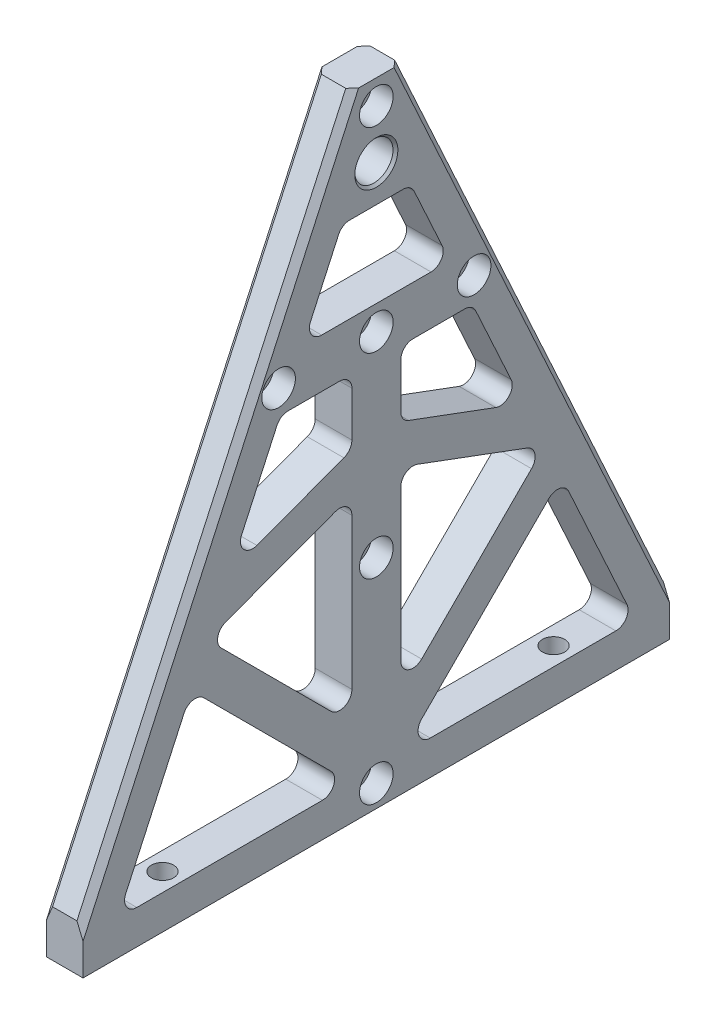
ISO-10303-21;
HEADER;
FILE_DESCRIPTION(('STEP AP214'),'2;1');
FILE_NAME('part.step','',(''),(''),'','','');
FILE_SCHEMA(('AUTOMOTIVE_DESIGN { 1 0 10303 214 1 1 1 1 }'));
ENDSEC;
DATA;
#1=APPLICATION_CONTEXT('core data for automotive mechanical design processes');
#2=APPLICATION_PROTOCOL_DEFINITION('international standard','automotive_design',2000,#1);
#3=PRODUCT_CONTEXT('',#1,'mechanical');
#4=PRODUCT('Part','Part','',(#3));
#5=PRODUCT_RELATED_PRODUCT_CATEGORY('part','',(#4));
#6=PRODUCT_DEFINITION_FORMATION('','',#4);
#7=PRODUCT_DEFINITION_CONTEXT('part definition',#1,'design');
#8=PRODUCT_DEFINITION('design','',#6,#7);
#9=PRODUCT_DEFINITION_SHAPE('','',#8);
#10=(LENGTH_UNIT() NAMED_UNIT(*) SI_UNIT(.MILLI.,.METRE.));
#11=(NAMED_UNIT(*) PLANE_ANGLE_UNIT() SI_UNIT($,.RADIAN.));
#12=(NAMED_UNIT(*) SI_UNIT($,.STERADIAN.) SOLID_ANGLE_UNIT());
#13=UNCERTAINTY_MEASURE_WITH_UNIT(LENGTH_MEASURE(1.E-05),#10,'distance_accuracy_value','');
#14=(GEOMETRIC_REPRESENTATION_CONTEXT(3) GLOBAL_UNCERTAINTY_ASSIGNED_CONTEXT((#13)) GLOBAL_UNIT_ASSIGNED_CONTEXT((#10,
#11,#12)) REPRESENTATION_CONTEXT('',''));
#15=CARTESIAN_POINT('',(0.,0.,0.));
#16=DIRECTION('',(0.,0.,1.));
#17=DIRECTION('',(1.,0.,0.));
#18=AXIS2_PLACEMENT_3D('',#15,#16,#17);
#19=CARTESIAN_POINT('',(9.52500000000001,28.5750000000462,139.7));
#20=DIRECTION('',(0.,-1.,0.));
#21=DIRECTION('',(1.,0.,0.));
#22=AXIS2_PLACEMENT_3D('',#19,#20,#21);
#23=CONICAL_SURFACE('',#22,4.6735999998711,1.02974425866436);
#24=CARTESIAN_POINT('',(9.52500000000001,31.3831821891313,139.7));
#25=VERTEX_POINT('',#24);
#26=VERTEX_LOOP('',#25);
#27=FACE_BOUND('',#26,.T.);
#28=CARTESIAN_POINT('',(9.52500000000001,28.575,139.7));
#29=DIRECTION('',(0.,-1.,0.));
#30=DIRECTION('',(0.,0.,-1.));
#31=AXIS2_PLACEMENT_3D('',#28,#29,#30);
#32=CIRCLE('',#31,4.6736);
#33=CARTESIAN_POINT('',(9.52500000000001,28.575,135.0264));
#34=VERTEX_POINT('',#33);
#35=EDGE_CURVE('E358',#34,#34,#32,.T.);
#36=ORIENTED_EDGE('',*,*,#35,.T.);
#37=EDGE_LOOP('',(#36));
#38=FACE_BOUND('',#37,.T.);
#39=ADVANCED_FACE('F24',(#27,#38),#23,.F.);
#40=CARTESIAN_POINT('',(9.52499999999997,28.5750000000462,-139.7));
#41=DIRECTION('',(0.,-1.,0.));
#42=DIRECTION('',(1.,0.,0.));
#43=AXIS2_PLACEMENT_3D('',#40,#41,#42);
#44=CONICAL_SURFACE('',#43,4.67359999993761,1.0297442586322);
#45=CARTESIAN_POINT('',(9.52499999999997,31.3831821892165,-139.699999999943));
#46=VERTEX_POINT('',#45);
#47=VERTEX_LOOP('',#46);
#48=FACE_BOUND('',#47,.T.);
#49=CARTESIAN_POINT('',(9.52499999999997,28.575,-139.7));
#50=DIRECTION('',(0.,-1.,0.));
#51=DIRECTION('',(0.,0.,-1.));
#52=AXIS2_PLACEMENT_3D('',#49,#50,#51);
#53=CIRCLE('',#52,4.6736);
#54=CARTESIAN_POINT('',(9.52499999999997,28.575,-144.3736));
#55=VERTEX_POINT('',#54);
#56=EDGE_CURVE('E360',#55,#55,#53,.T.);
#57=ORIENTED_EDGE('',*,*,#56,.T.);
#58=EDGE_LOOP('',(#57));
#59=FACE_BOUND('',#58,.T.);
#60=ADVANCED_FACE('F355',(#48,#59),#44,.F.);
#61=CARTESIAN_POINT('',(9.52500000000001,0.,139.7));
#62=DIRECTION('',(0.,-1.,0.));
#63=DIRECTION('',(0.,0.,-1.));
#64=AXIS2_PLACEMENT_3D('',#61,#62,#63);
#65=CYLINDRICAL_SURFACE('',#64,4.6736);
#66=ORIENTED_EDGE('',*,*,#35,.F.);
#67=EDGE_LOOP('',(#66));
#68=FACE_BOUND('',#67,.T.);
#69=CARTESIAN_POINT('',(9.52500000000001,0.,139.7));
#70=DIRECTION('',(0.,-1.,0.));
#71=DIRECTION('',(0.,0.,-1.));
#72=AXIS2_PLACEMENT_3D('',#69,#70,#71);
#73=CIRCLE('',#72,4.6736);
#74=CARTESIAN_POINT('',(9.52500000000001,0.,135.0264));
#75=VERTEX_POINT('',#74);
#76=EDGE_CURVE('E629',#75,#75,#73,.T.);
#77=ORIENTED_EDGE('',*,*,#76,.T.);
#78=EDGE_LOOP('',(#77));
#79=FACE_BOUND('',#78,.T.);
#80=ADVANCED_FACE('F1298',(#68,#79),#65,.F.);
#81=CARTESIAN_POINT('',(9.52499999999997,0.,-139.7));
#82=DIRECTION('',(0.,-1.,0.));
#83=DIRECTION('',(0.,0.,-1.));
#84=AXIS2_PLACEMENT_3D('',#81,#82,#83);
#85=CYLINDRICAL_SURFACE('',#84,4.6736);
#86=ORIENTED_EDGE('',*,*,#56,.F.);
#87=EDGE_LOOP('',(#86));
#88=FACE_BOUND('',#87,.T.);
#89=CARTESIAN_POINT('',(9.52499999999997,0.,-139.7));
#90=DIRECTION('',(0.,-1.,0.));
#91=DIRECTION('',(0.,0.,-1.));
#92=AXIS2_PLACEMENT_3D('',#89,#90,#91);
#93=CIRCLE('',#92,4.6736);
#94=CARTESIAN_POINT('',(9.52499999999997,0.,-144.3736));
#95=VERTEX_POINT('',#94);
#96=EDGE_CURVE('E625',#95,#95,#93,.T.);
#97=ORIENTED_EDGE('',*,*,#96,.T.);
#98=EDGE_LOOP('',(#97));
#99=FACE_BOUND('',#98,.T.);
#100=ADVANCED_FACE('F1294',(#88,#99),#85,.F.);
#101=CARTESIAN_POINT('',(19.05,292.1,0.));
#102=DIRECTION('',(1.,0.,0.));
#103=DIRECTION('',(0.,1.,0.));
#104=AXIS2_PLACEMENT_3D('',#101,#102,#103);
#105=CONICAL_SURFACE('',#104,11.1887000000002,0.785398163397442);
#106=CARTESIAN_POINT('',(19.05,292.1,0.));
#107=DIRECTION('',(1.,0.,0.));
#108=DIRECTION('',(0.,1.,0.));
#109=AXIS2_PLACEMENT_3D('',#106,#107,#108);
#110=CIRCLE('',#109,11.1887000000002);
#111=CARTESIAN_POINT('',(19.05,303.2887,0.));
#112=VERTEX_POINT('',#111);
#113=EDGE_CURVE('E613',#112,#112,#110,.T.);
#114=ORIENTED_EDGE('',*,*,#113,.T.);
#115=EDGE_LOOP('',(#114));
#116=FACE_BOUND('',#115,.T.);
#117=CARTESIAN_POINT('',(17.7799999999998,292.1,0.));
#118=DIRECTION('',(1.,0.,0.));
#119=DIRECTION('',(0.,0.,-1.));
#120=AXIS2_PLACEMENT_3D('',#117,#118,#119);
#121=CIRCLE('',#120,9.91870000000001);
#122=CARTESIAN_POINT('',(17.7799999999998,292.1,-9.91870000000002));
#123=VERTEX_POINT('',#122);
#124=EDGE_CURVE('E363',#123,#123,#121,.F.);
#125=ORIENTED_EDGE('',*,*,#124,.T.);
#126=EDGE_LOOP('',(#125));
#127=FACE_BOUND('',#126,.T.);
#128=ADVANCED_FACE('F1291',(#116,#127),#105,.F.);
#129=CARTESIAN_POINT('',(19.05,1.26999999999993,0.));
#130=DIRECTION('',(-0.707106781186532,0.707106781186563,0.));
#131=DIRECTION('',(-0.707106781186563,-0.707106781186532,0.));
#132=AXIS2_PLACEMENT_3D('',#129,#130,#131);
#133=PLANE('',#132);
#134=DIRECTION('',(0.,0.,1.));
#135=VECTOR('',#134,1.);
#136=CARTESIAN_POINT('',(17.78,0.,-152.4));
#137=LINE('',#136,#135);
#138=CARTESIAN_POINT('',(17.78,0.,151.13));
#139=VERTEX_POINT('',#138);
#140=CARTESIAN_POINT('',(17.78,0.,-151.13));
#141=VERTEX_POINT('',#140);
#142=EDGE_CURVE('E628',#139,#141,#137,.F.);
#143=ORIENTED_EDGE('',*,*,#142,.T.);
#144=DIRECTION('',(0.577350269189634,0.577350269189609,-0.577350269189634));
#145=VECTOR('',#144,1.);
#146=CARTESIAN_POINT('',(17.78,0.,-151.13));
#147=LINE('',#146,#145);
#148=CARTESIAN_POINT('',(19.05,1.26999999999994,-152.4));
#149=VERTEX_POINT('',#148);
#150=EDGE_CURVE('E632',#141,#149,#147,.T.);
#151=ORIENTED_EDGE('',*,*,#150,.T.);
#152=DIRECTION('',(0.,0.,1.));
#153=VECTOR('',#152,1.);
#154=CARTESIAN_POINT('',(19.05,1.26999999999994,0.));
#155=LINE('',#154,#153);
#156=CARTESIAN_POINT('',(19.05,1.26999999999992,152.4));
#157=VERTEX_POINT('',#156);
#158=EDGE_CURVE('E612',#149,#157,#155,.T.);
#159=ORIENTED_EDGE('',*,*,#158,.T.);
#160=DIRECTION('',(-0.577350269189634,-0.577350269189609,-0.577350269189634));
#161=VECTOR('',#160,1.);
#162=CARTESIAN_POINT('',(19.05,1.26999999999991,152.4));
#163=LINE('',#162,#161);
#164=EDGE_CURVE('E341',#157,#139,#163,.T.);
#165=ORIENTED_EDGE('',*,*,#164,.T.);
#166=EDGE_LOOP('',(#143,#151,#159,#165));
#167=FACE_BOUND('',#166,.T.);
#168=ADVANCED_FACE('F1287',(#167),#133,.F.);
#169=CARTESIAN_POINT('',(19.05,215.9,-50.8000000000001));
#170=DIRECTION('',(1.,0.,0.));
#171=DIRECTION('',(0.,0.,-1.));
#172=AXIS2_PLACEMENT_3D('',#169,#170,#171);
#173=CYLINDRICAL_SURFACE('',#172,8.73759999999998);
#174=CARTESIAN_POINT('',(7.9248,215.9,-50.8000000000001));
#175=DIRECTION('',(1.,0.,0.));
#176=DIRECTION('',(0.,0.,-1.));
#177=AXIS2_PLACEMENT_3D('',#174,#175,#176);
#178=CIRCLE('',#177,8.73759999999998);
#179=CARTESIAN_POINT('',(7.9248,215.9,-59.5376000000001));
#180=VERTEX_POINT('',#179);
#181=EDGE_CURVE('E633',#180,#180,#178,.F.);
#182=ORIENTED_EDGE('',*,*,#181,.T.);
#183=EDGE_LOOP('',(#182));
#184=FACE_BOUND('',#183,.T.);
#185=CARTESIAN_POINT('',(19.05,215.9,-50.8000000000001));
#186=DIRECTION('',(1.,0.,0.));
#187=DIRECTION('',(0.,0.,-1.));
#188=AXIS2_PLACEMENT_3D('',#185,#186,#187);
#189=CIRCLE('',#188,8.73759999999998);
#190=CARTESIAN_POINT('',(19.05,215.9,-59.5376000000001));
#191=VERTEX_POINT('',#190);
#192=EDGE_CURVE('E609',#191,#191,#189,.T.);
#193=ORIENTED_EDGE('',*,*,#192,.T.);
#194=EDGE_LOOP('',(#193));
#195=FACE_BOUND('',#194,.T.);
#196=ADVANCED_FACE('F1283',(#184,#195),#173,.F.);
#197=CARTESIAN_POINT('',(19.05,215.9,50.7999999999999));
#198=DIRECTION('',(1.,0.,0.));
#199=DIRECTION('',(0.,0.,-1.));
#200=AXIS2_PLACEMENT_3D('',#197,#198,#199);
#201=CYLINDRICAL_SURFACE('',#200,8.73759999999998);
#202=CARTESIAN_POINT('',(7.9248,215.9,50.7999999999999));
#203=DIRECTION('',(1.,0.,0.));
#204=DIRECTION('',(0.,0.,-1.));
#205=AXIS2_PLACEMENT_3D('',#202,#203,#204);
#206=CIRCLE('',#205,8.73759999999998);
#207=CARTESIAN_POINT('',(7.9248,215.9,42.0623999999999));
#208=VERTEX_POINT('',#207);
#209=EDGE_CURVE('E636',#208,#208,#206,.F.);
#210=ORIENTED_EDGE('',*,*,#209,.T.);
#211=EDGE_LOOP('',(#210));
#212=FACE_BOUND('',#211,.T.);
#213=CARTESIAN_POINT('',(19.05,215.9,50.7999999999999));
#214=DIRECTION('',(1.,0.,0.));
#215=DIRECTION('',(0.,0.,-1.));
#216=AXIS2_PLACEMENT_3D('',#213,#214,#215);
#217=CIRCLE('',#216,8.73759999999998);
#218=CARTESIAN_POINT('',(19.05,215.9,42.0623999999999));
#219=VERTEX_POINT('',#218);
#220=EDGE_CURVE('E606',#219,#219,#217,.T.);
#221=ORIENTED_EDGE('',*,*,#220,.T.);
#222=EDGE_LOOP('',(#221));
#223=FACE_BOUND('',#222,.T.);
#224=ADVANCED_FACE('F1279',(#212,#223),#201,.F.);
#225=CARTESIAN_POINT('',(19.05,114.3,0.));
#226=DIRECTION('',(1.,0.,0.));
#227=DIRECTION('',(0.,0.,-1.));
#228=AXIS2_PLACEMENT_3D('',#225,#226,#227);
#229=CYLINDRICAL_SURFACE('',#228,8.7376);
#230=CARTESIAN_POINT('',(7.9248,114.3,0.));
#231=DIRECTION('',(1.,0.,0.));
#232=DIRECTION('',(0.,0.,-1.));
#233=AXIS2_PLACEMENT_3D('',#230,#231,#232);
#234=CIRCLE('',#233,8.7376);
#235=CARTESIAN_POINT('',(7.9248,114.3,-8.73760000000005));
#236=VERTEX_POINT('',#235);
#237=EDGE_CURVE('E639',#236,#236,#234,.F.);
#238=ORIENTED_EDGE('',*,*,#237,.T.);
#239=EDGE_LOOP('',(#238));
#240=FACE_BOUND('',#239,.T.);
#241=CARTESIAN_POINT('',(19.05,114.3,0.));
#242=DIRECTION('',(1.,0.,0.));
#243=DIRECTION('',(0.,0.,-1.));
#244=AXIS2_PLACEMENT_3D('',#241,#242,#243);
#245=CIRCLE('',#244,8.7376);
#246=CARTESIAN_POINT('',(19.05,114.3,-8.73760000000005));
#247=VERTEX_POINT('',#246);
#248=EDGE_CURVE('E603',#247,#247,#245,.T.);
#249=ORIENTED_EDGE('',*,*,#248,.T.);
#250=EDGE_LOOP('',(#249));
#251=FACE_BOUND('',#250,.T.);
#252=ADVANCED_FACE('F1275',(#240,#251),#229,.F.);
#253=CARTESIAN_POINT('',(19.05,12.7,0.));
#254=DIRECTION('',(1.,0.,0.));
#255=DIRECTION('',(0.,0.,-1.));
#256=AXIS2_PLACEMENT_3D('',#253,#254,#255);
#257=CYLINDRICAL_SURFACE('',#256,8.7376);
#258=CARTESIAN_POINT('',(7.9248,12.7,0.));
#259=DIRECTION('',(1.,0.,0.));
#260=DIRECTION('',(0.,0.,-1.));
#261=AXIS2_PLACEMENT_3D('',#258,#259,#260);
#262=CIRCLE('',#261,8.7376);
#263=CARTESIAN_POINT('',(7.9248,12.7,-8.73760000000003));
#264=VERTEX_POINT('',#263);
#265=EDGE_CURVE('E642',#264,#264,#262,.F.);
#266=ORIENTED_EDGE('',*,*,#265,.T.);
#267=EDGE_LOOP('',(#266));
#268=FACE_BOUND('',#267,.T.);
#269=CARTESIAN_POINT('',(19.05,12.7,0.));
#270=DIRECTION('',(1.,0.,0.));
#271=DIRECTION('',(0.,0.,-1.));
#272=AXIS2_PLACEMENT_3D('',#269,#270,#271);
#273=CIRCLE('',#272,8.7376);
#274=CARTESIAN_POINT('',(19.05,12.7,-8.73760000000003));
#275=VERTEX_POINT('',#274);
#276=EDGE_CURVE('E600',#275,#275,#273,.T.);
#277=ORIENTED_EDGE('',*,*,#276,.T.);
#278=EDGE_LOOP('',(#277));
#279=FACE_BOUND('',#278,.T.);
#280=ADVANCED_FACE('F1272',(#268,#279),#257,.F.);
#281=CARTESIAN_POINT('',(19.05,215.9,0.));
#282=DIRECTION('',(1.,0.,0.));
#283=DIRECTION('',(0.,0.,-1.));
#284=AXIS2_PLACEMENT_3D('',#281,#282,#283);
#285=CYLINDRICAL_SURFACE('',#284,8.73759999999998);
#286=CARTESIAN_POINT('',(7.9248,215.9,0.));
#287=DIRECTION('',(1.,0.,0.));
#288=DIRECTION('',(0.,0.,-1.));
#289=AXIS2_PLACEMENT_3D('',#286,#287,#288);
#290=CIRCLE('',#289,8.73759999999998);
#291=CARTESIAN_POINT('',(7.9248,215.9,-8.73760000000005));
#292=VERTEX_POINT('',#291);
#293=EDGE_CURVE('E644',#292,#292,#290,.F.);
#294=ORIENTED_EDGE('',*,*,#293,.T.);
#295=EDGE_LOOP('',(#294));
#296=FACE_BOUND('',#295,.T.);
#297=CARTESIAN_POINT('',(19.05,215.9,0.));
#298=DIRECTION('',(1.,0.,0.));
#299=DIRECTION('',(0.,0.,-1.));
#300=AXIS2_PLACEMENT_3D('',#297,#298,#299);
#301=CIRCLE('',#300,8.73759999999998);
#302=CARTESIAN_POINT('',(19.05,215.9,-8.73760000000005));
#303=VERTEX_POINT('',#302);
#304=EDGE_CURVE('E597',#303,#303,#301,.T.);
#305=ORIENTED_EDGE('',*,*,#304,.T.);
#306=EDGE_LOOP('',(#305));
#307=FACE_BOUND('',#306,.T.);
#308=ADVANCED_FACE('F1269',(#296,#307),#285,.F.);
#309=CARTESIAN_POINT('',(19.05,317.5,0.));
#310=DIRECTION('',(1.,0.,0.));
#311=DIRECTION('',(0.,0.,-1.));
#312=AXIS2_PLACEMENT_3D('',#309,#310,#311);
#313=CYLINDRICAL_SURFACE('',#312,8.73760000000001);
#314=CARTESIAN_POINT('',(7.9248,317.5,0.));
#315=DIRECTION('',(1.,0.,0.));
#316=DIRECTION('',(0.,0.,-1.));
#317=AXIS2_PLACEMENT_3D('',#314,#315,#316);
#318=CIRCLE('',#317,8.73760000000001);
#319=CARTESIAN_POINT('',(7.9248,317.5,-8.73760000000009));
#320=VERTEX_POINT('',#319);
#321=EDGE_CURVE('E27',#320,#320,#318,.F.);
#322=ORIENTED_EDGE('',*,*,#321,.T.);
#323=EDGE_LOOP('',(#322));
#324=FACE_BOUND('',#323,.T.);
#325=CARTESIAN_POINT('',(19.05,317.5,0.));
#326=DIRECTION('',(1.,0.,0.));
#327=DIRECTION('',(0.,0.,-1.));
#328=AXIS2_PLACEMENT_3D('',#325,#326,#327);
#329=CIRCLE('',#328,8.73760000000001);
#330=CARTESIAN_POINT('',(19.05,317.5,-8.73760000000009));
#331=VERTEX_POINT('',#330);
#332=EDGE_CURVE('E594',#331,#331,#329,.T.);
#333=ORIENTED_EDGE('',*,*,#332,.T.);
#334=EDGE_LOOP('',(#333));
#335=FACE_BOUND('',#334,.T.);
#336=ADVANCED_FACE('F1265',(#324,#335),#313,.F.);
#337=CARTESIAN_POINT('',(0.,292.1,0.));
#338=DIRECTION('',(1.,0.,0.));
#339=DIRECTION('',(0.,0.,-1.));
#340=AXIS2_PLACEMENT_3D('',#337,#338,#339);
#341=CYLINDRICAL_SURFACE('',#340,9.91870000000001);
#342=CARTESIAN_POINT('',(1.26999999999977,292.1,0.));
#343=DIRECTION('',(-1.,0.,0.));
#344=DIRECTION('',(0.,0.,1.));
#345=AXIS2_PLACEMENT_3D('',#342,#343,#344);
#346=CIRCLE('',#345,9.91870000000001);
#347=CARTESIAN_POINT('',(1.26999999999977,292.1,9.91870000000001));
#348=VERTEX_POINT('',#347);
#349=EDGE_CURVE('E579',#348,#348,#346,.T.);
#350=ORIENTED_EDGE('',*,*,#349,.T.);
#351=EDGE_LOOP('',(#350));
#352=FACE_BOUND('',#351,.T.);
#353=ORIENTED_EDGE('',*,*,#124,.F.);
#354=EDGE_LOOP('',(#353));
#355=FACE_BOUND('',#354,.T.);
#356=ADVANCED_FACE('F1261',(#352,#355),#341,.F.);
#357=CARTESIAN_POINT('',(7.9248,322.5419,0.));
#358=DIRECTION('',(-1.,0.,0.));
#359=DIRECTION('',(0.,0.,1.));
#360=AXIS2_PLACEMENT_3D('',#357,#358,#359);
#361=PLANE('',#360);
#362=ORIENTED_EDGE('',*,*,#321,.F.);
#363=EDGE_LOOP('',(#362));
#364=FACE_BOUND('',#363,.T.);
#365=CARTESIAN_POINT('',(7.9248,317.5,0.));
#366=DIRECTION('',(1.,0.,0.));
#367=DIRECTION('',(0.,0.,-1.));
#368=AXIS2_PLACEMENT_3D('',#365,#366,#367);
#369=CIRCLE('',#368,5.04189999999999);
#370=CARTESIAN_POINT('',(7.9248,317.5,-5.04190000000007));
#371=VERTEX_POINT('',#370);
#372=EDGE_CURVE('E576',#371,#371,#369,.F.);
#373=ORIENTED_EDGE('',*,*,#372,.T.);
#374=EDGE_LOOP('',(#373));
#375=FACE_BOUND('',#374,.T.);
#376=ADVANCED_FACE('F1257',(#364,#375),#361,.F.);
#377=CARTESIAN_POINT('',(7.9248,220.9419,0.));
#378=DIRECTION('',(-1.,0.,0.));
#379=DIRECTION('',(0.,0.,1.));
#380=AXIS2_PLACEMENT_3D('',#377,#378,#379);
#381=PLANE('',#380);
#382=ORIENTED_EDGE('',*,*,#293,.F.);
#383=EDGE_LOOP('',(#382));
#384=FACE_BOUND('',#383,.T.);
#385=CARTESIAN_POINT('',(7.9248,215.9,0.));
#386=DIRECTION('',(1.,0.,0.));
#387=DIRECTION('',(0.,0.,-1.));
#388=AXIS2_PLACEMENT_3D('',#385,#386,#387);
#389=CIRCLE('',#388,5.04189999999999);
#390=CARTESIAN_POINT('',(7.9248,215.9,-5.04190000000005));
#391=VERTEX_POINT('',#390);
#392=EDGE_CURVE('E573',#391,#391,#389,.F.);
#393=ORIENTED_EDGE('',*,*,#392,.T.);
#394=EDGE_LOOP('',(#393));
#395=FACE_BOUND('',#394,.T.);
#396=ADVANCED_FACE('F1253',(#384,#395),#381,.F.);
#397=CARTESIAN_POINT('',(7.9248,17.7419,0.));
#398=DIRECTION('',(-1.,0.,0.));
#399=DIRECTION('',(0.,0.,1.));
#400=AXIS2_PLACEMENT_3D('',#397,#398,#399);
#401=PLANE('',#400);
#402=ORIENTED_EDGE('',*,*,#265,.F.);
#403=EDGE_LOOP('',(#402));
#404=FACE_BOUND('',#403,.T.);
#405=CARTESIAN_POINT('',(7.9248,12.7,0.));
#406=DIRECTION('',(1.,0.,0.));
#407=DIRECTION('',(0.,0.,-1.));
#408=AXIS2_PLACEMENT_3D('',#405,#406,#407);
#409=CIRCLE('',#408,5.0419);
#410=CARTESIAN_POINT('',(7.9248,12.7,-5.04190000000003));
#411=VERTEX_POINT('',#410);
#412=EDGE_CURVE('E570',#411,#411,#409,.F.);
#413=ORIENTED_EDGE('',*,*,#412,.T.);
#414=EDGE_LOOP('',(#413));
#415=FACE_BOUND('',#414,.T.);
#416=ADVANCED_FACE('F1249',(#404,#415),#401,.F.);
#417=CARTESIAN_POINT('',(7.9248,119.3419,0.));
#418=DIRECTION('',(-1.,0.,0.));
#419=DIRECTION('',(0.,0.,1.));
#420=AXIS2_PLACEMENT_3D('',#417,#418,#419);
#421=PLANE('',#420);
#422=ORIENTED_EDGE('',*,*,#237,.F.);
#423=EDGE_LOOP('',(#422));
#424=FACE_BOUND('',#423,.T.);
#425=CARTESIAN_POINT('',(7.9248,114.3,0.));
#426=DIRECTION('',(1.,0.,0.));
#427=DIRECTION('',(0.,0.,-1.));
#428=AXIS2_PLACEMENT_3D('',#425,#426,#427);
#429=CIRCLE('',#428,5.0419);
#430=CARTESIAN_POINT('',(7.9248,114.3,-5.04190000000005));
#431=VERTEX_POINT('',#430);
#432=EDGE_CURVE('E567',#431,#431,#429,.F.);
#433=ORIENTED_EDGE('',*,*,#432,.T.);
#434=EDGE_LOOP('',(#433));
#435=FACE_BOUND('',#434,.T.);
#436=ADVANCED_FACE('F1245',(#424,#435),#421,.F.);
#437=CARTESIAN_POINT('',(7.9248,220.9419,50.7999999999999));
#438=DIRECTION('',(-1.,0.,0.));
#439=DIRECTION('',(0.,0.,1.));
#440=AXIS2_PLACEMENT_3D('',#437,#438,#439);
#441=PLANE('',#440);
#442=ORIENTED_EDGE('',*,*,#209,.F.);
#443=EDGE_LOOP('',(#442));
#444=FACE_BOUND('',#443,.T.);
#445=CARTESIAN_POINT('',(7.9248,215.9,50.7999999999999));
#446=DIRECTION('',(1.,0.,0.));
#447=DIRECTION('',(0.,0.,-1.));
#448=AXIS2_PLACEMENT_3D('',#445,#446,#447);
#449=CIRCLE('',#448,5.04189999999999);
#450=CARTESIAN_POINT('',(7.9248,215.9,45.7580999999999));
#451=VERTEX_POINT('',#450);
#452=EDGE_CURVE('E564',#451,#451,#449,.F.);
#453=ORIENTED_EDGE('',*,*,#452,.T.);
#454=EDGE_LOOP('',(#453));
#455=FACE_BOUND('',#454,.T.);
#456=ADVANCED_FACE('F1241',(#444,#455),#441,.F.);
#457=CARTESIAN_POINT('',(7.9248,220.9419,-50.8000000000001));
#458=DIRECTION('',(-1.,0.,0.));
#459=DIRECTION('',(0.,0.,1.));
#460=AXIS2_PLACEMENT_3D('',#457,#458,#459);
#461=PLANE('',#460);
#462=ORIENTED_EDGE('',*,*,#181,.F.);
#463=EDGE_LOOP('',(#462));
#464=FACE_BOUND('',#463,.T.);
#465=CARTESIAN_POINT('',(7.9248,215.9,-50.8000000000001));
#466=DIRECTION('',(1.,0.,0.));
#467=DIRECTION('',(0.,0.,-1.));
#468=AXIS2_PLACEMENT_3D('',#465,#466,#467);
#469=CIRCLE('',#468,5.04189999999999);
#470=CARTESIAN_POINT('',(7.9248,215.9,-55.8419000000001));
#471=VERTEX_POINT('',#470);
#472=EDGE_CURVE('E561',#471,#471,#469,.F.);
#473=ORIENTED_EDGE('',*,*,#472,.T.);
#474=EDGE_LOOP('',(#473));
#475=FACE_BOUND('',#474,.T.);
#476=ADVANCED_FACE('F1237',(#464,#475),#461,.F.);
#477=CARTESIAN_POINT('',(9.52500000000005,0.,101.6));
#478=DIRECTION('',(0.,-1.,0.));
#479=DIRECTION('',(0.,0.,-1.));
#480=AXIS2_PLACEMENT_3D('',#477,#478,#479);
#481=CYLINDRICAL_SURFACE('',#480,5.75436999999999);
#482=CARTESIAN_POINT('',(9.52500000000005,19.05,101.6));
#483=DIRECTION('',(0.,-1.,0.));
#484=DIRECTION('',(0.,0.,-1.));
#485=AXIS2_PLACEMENT_3D('',#482,#483,#484);
#486=CIRCLE('',#485,5.75436999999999);
#487=CARTESIAN_POINT('',(9.52500000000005,19.05,95.84563));
#488=VERTEX_POINT('',#487);
#489=EDGE_CURVE('E550',#488,#488,#486,.F.);
#490=ORIENTED_EDGE('',*,*,#489,.T.);
#491=EDGE_LOOP('',(#490));
#492=FACE_BOUND('',#491,.T.);
#493=CARTESIAN_POINT('',(9.52500000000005,0.,101.6));
#494=DIRECTION('',(0.,-1.,0.));
#495=DIRECTION('',(0.,0.,-1.));
#496=AXIS2_PLACEMENT_3D('',#493,#494,#495);
#497=CIRCLE('',#496,5.75436999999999);
#498=CARTESIAN_POINT('',(9.52500000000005,0.,95.84563));
#499=VERTEX_POINT('',#498);
#500=EDGE_CURVE('E621',#499,#499,#497,.T.);
#501=ORIENTED_EDGE('',*,*,#500,.T.);
#502=EDGE_LOOP('',(#501));
#503=FACE_BOUND('',#502,.T.);
#504=ADVANCED_FACE('F1233',(#492,#503),#481,.F.);
#505=CARTESIAN_POINT('',(19.05,1.26999999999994,-152.4));
#506=DIRECTION('',(0.,0.707106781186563,0.707106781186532));
#507=DIRECTION('',(0.,-0.707106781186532,0.707106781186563));
#508=AXIS2_PLACEMENT_3D('',#505,#506,#507);
#509=PLANE('',#508);
#510=DIRECTION('',(1.,0.,0.));
#511=VECTOR('',#510,1.);
#512=CARTESIAN_POINT('',(19.05,0.,-151.13));
#513=LINE('',#512,#511);
#514=CARTESIAN_POINT('',(1.26999999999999,0.,-151.13));
#515=VERTEX_POINT('',#514);
#516=EDGE_CURVE('E624',#141,#515,#513,.F.);
#517=ORIENTED_EDGE('',*,*,#516,.T.);
#518=DIRECTION('',(0.577350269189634,-0.577350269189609,0.577350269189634));
#519=VECTOR('',#518,1.);
#520=CARTESIAN_POINT('',(0.,1.26999999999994,-152.4));
#521=LINE('',#520,#519);
#522=CARTESIAN_POINT('',(0.,1.26999999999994,-152.4));
#523=VERTEX_POINT('',#522);
#524=EDGE_CURVE('E789',#523,#515,#521,.T.);
#525=ORIENTED_EDGE('',*,*,#524,.F.);
#526=DIRECTION('',(1.,0.,0.));
#527=VECTOR('',#526,1.);
#528=CARTESIAN_POINT('',(19.05,1.26999999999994,-152.4));
#529=LINE('',#528,#527);
#530=EDGE_CURVE('E780',#523,#149,#529,.T.);
#531=ORIENTED_EDGE('',*,*,#530,.T.);
#532=ORIENTED_EDGE('',*,*,#150,.F.);
#533=EDGE_LOOP('',(#517,#525,#531,#532));
#534=FACE_BOUND('',#533,.T.);
#535=ADVANCED_FACE('F1229',(#534),#509,.F.);
#536=CARTESIAN_POINT('',(19.05,0.,-152.4));
#537=DIRECTION('',(0.,1.,0.));
#538=DIRECTION('',(0.,0.,1.));
#539=AXIS2_PLACEMENT_3D('',#536,#537,#538);
#540=PLANE('',#539);
#541=CARTESIAN_POINT('',(9.52500000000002,0.,-101.6));
#542=DIRECTION('',(0.,-1.,0.));
#543=DIRECTION('',(0.,0.,-1.));
#544=AXIS2_PLACEMENT_3D('',#541,#542,#543);
#545=CIRCLE('',#544,5.75436999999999);
#546=CARTESIAN_POINT('',(9.52500000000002,0.,-107.35437));
#547=VERTEX_POINT('',#546);
#548=EDGE_CURVE('E617',#547,#547,#545,.F.);
#549=ORIENTED_EDGE('',*,*,#548,.T.);
#550=EDGE_LOOP('',(#549));
#551=FACE_BOUND('',#550,.T.);
#552=ORIENTED_EDGE('',*,*,#500,.F.);
#553=EDGE_LOOP('',(#552));
#554=FACE_BOUND('',#553,.T.);
#555=ORIENTED_EDGE('',*,*,#516,.F.);
#556=ORIENTED_EDGE('',*,*,#142,.F.);
#557=DIRECTION('',(1.,0.,0.));
#558=VECTOR('',#557,1.);
#559=CARTESIAN_POINT('',(19.05,0.,151.13));
#560=LINE('',#559,#558);
#561=CARTESIAN_POINT('',(1.26999999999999,0.,151.13));
#562=VERTEX_POINT('',#561);
#563=EDGE_CURVE('E694',#139,#562,#560,.F.);
#564=ORIENTED_EDGE('',*,*,#563,.T.);
#565=DIRECTION('',(0.,0.,1.));
#566=VECTOR('',#565,1.);
#567=CARTESIAN_POINT('',(1.26999999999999,0.,-152.4));
#568=LINE('',#567,#566);
#569=EDGE_CURVE('E792',#515,#562,#568,.T.);
#570=ORIENTED_EDGE('',*,*,#569,.F.);
#571=EDGE_LOOP('',(#555,#556,#564,#570));
#572=FACE_BOUND('',#571,.T.);
#573=ORIENTED_EDGE('',*,*,#96,.F.);
#574=EDGE_LOOP('',(#573));
#575=FACE_BOUND('',#574,.T.);
#576=ORIENTED_EDGE('',*,*,#76,.F.);
#577=EDGE_LOOP('',(#576));
#578=FACE_BOUND('',#577,.T.);
#579=ADVANCED_FACE('F1225',(#551,#554,#572,#575,#578),#540,.F.);
#580=CARTESIAN_POINT('',(19.05,0.,151.13));
#581=DIRECTION('',(0.,0.707106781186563,-0.707106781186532));
#582=DIRECTION('',(0.,0.707106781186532,0.707106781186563));
#583=AXIS2_PLACEMENT_3D('',#580,#581,#582);
#584=PLANE('',#583);
#585=ORIENTED_EDGE('',*,*,#563,.F.);
#586=ORIENTED_EDGE('',*,*,#164,.F.);
#587=DIRECTION('',(-1.,0.,0.));
#588=VECTOR('',#587,1.);
#589=CARTESIAN_POINT('',(19.05,1.26999999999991,152.4));
#590=LINE('',#589,#588);
#591=CARTESIAN_POINT('',(0.,1.26999999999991,152.4));
#592=VERTEX_POINT('',#591);
#593=EDGE_CURVE('E804',#157,#592,#590,.T.);
#594=ORIENTED_EDGE('',*,*,#593,.T.);
#595=DIRECTION('',(-0.577350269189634,0.577350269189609,0.577350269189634));
#596=VECTOR('',#595,1.);
#597=CARTESIAN_POINT('',(1.26999999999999,0.,151.13));
#598=LINE('',#597,#596);
#599=EDGE_CURVE('E786',#562,#592,#598,.T.);
#600=ORIENTED_EDGE('',*,*,#599,.F.);
#601=EDGE_LOOP('',(#585,#586,#594,#600));
#602=FACE_BOUND('',#601,.T.);
#603=ADVANCED_FACE('F1221',(#602),#584,.F.);
#604=CARTESIAN_POINT('',(19.05,60.8105502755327,132.677564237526));
#605=DIRECTION('',(-0.707106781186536,-0.294619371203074,-0.642805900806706));
#606=DIRECTION('',(-0.672662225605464,0.,0.739949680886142));
#607=AXIS2_PLACEMENT_3D('',#604,#605,#606);
#608=PLANE('',#607);
#609=DIRECTION('',(0.,0.909064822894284,-0.416654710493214));
#610=VECTOR('',#609,1.);
#611=CARTESIAN_POINT('',(15.8749999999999,25.4,152.4));
#612=LINE('',#611,#610);
#613=CARTESIAN_POINT('',(15.8749999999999,330.2,12.7));
#614=VERTEX_POINT('',#613);
#615=CARTESIAN_POINT('',(15.8749999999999,25.4,152.4));
#616=VERTEX_POINT('',#615);
#617=EDGE_CURVE('E697',#614,#616,#612,.F.);
#618=ORIENTED_EDGE('',*,*,#617,.T.);
#619=DIRECTION('',(0.384605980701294,-0.923080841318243,0.));
#620=VECTOR('',#619,1.);
#621=CARTESIAN_POINT('',(15.8749999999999,25.4,152.4));
#622=LINE('',#621,#620);
#623=CARTESIAN_POINT('',(19.05,17.7797813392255,152.4));
#624=VERTEX_POINT('',#623);
#625=EDGE_CURVE('E798',#616,#624,#622,.T.);
#626=ORIENTED_EDGE('',*,*,#625,.T.);
#627=DIRECTION('',(0.,0.909064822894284,-0.416654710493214));
#628=VECTOR('',#627,1.);
#629=CARTESIAN_POINT('',(19.05,17.7797813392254,152.4));
#630=LINE('',#629,#628);
#631=CARTESIAN_POINT('',(19.05,330.2,9.20739978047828));
#632=VERTEX_POINT('',#631);
#633=EDGE_CURVE('E616',#624,#632,#630,.T.);
#634=ORIENTED_EDGE('',*,*,#633,.T.);
#635=DIRECTION('',(-0.672662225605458,0.,0.739949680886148));
#636=VECTOR('',#635,1.);
#637=CARTESIAN_POINT('',(19.05,330.2,9.20739978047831));
#638=LINE('',#637,#636);
#639=EDGE_CURVE('E813',#632,#614,#638,.T.);
#640=ORIENTED_EDGE('',*,*,#639,.T.);
#641=EDGE_LOOP('',(#618,#626,#634,#640));
#642=FACE_BOUND('',#641,.T.);
#643=ADVANCED_FACE('F1217',(#642),#608,.F.);
#644=CARTESIAN_POINT('',(19.05,25.4,152.4));
#645=DIRECTION('',(0.,-0.416654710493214,-0.909064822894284));
#646=DIRECTION('',(0.,0.909064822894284,-0.416654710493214));
#647=AXIS2_PLACEMENT_3D('',#644,#645,#646);
#648=PLANE('',#647);
#649=DIRECTION('',(0.,0.909064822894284,-0.416654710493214));
#650=VECTOR('',#649,1.);
#651=CARTESIAN_POINT('',(3.17499999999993,25.4,152.4));
#652=LINE('',#651,#650);
#653=CARTESIAN_POINT('',(3.17499999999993,25.4,152.4));
#654=VERTEX_POINT('',#653);
#655=CARTESIAN_POINT('',(3.17499999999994,330.2,12.7));
#656=VERTEX_POINT('',#655);
#657=EDGE_CURVE('E810',#654,#656,#652,.T.);
#658=ORIENTED_EDGE('',*,*,#657,.F.);
#659=DIRECTION('',(-1.,0.,0.));
#660=VECTOR('',#659,1.);
#661=CARTESIAN_POINT('',(19.05,25.4,152.4));
#662=LINE('',#661,#660);
#663=EDGE_CURVE('E795',#654,#616,#662,.F.);
#664=ORIENTED_EDGE('',*,*,#663,.T.);
#665=ORIENTED_EDGE('',*,*,#617,.F.);
#666=DIRECTION('',(1.,0.,0.));
#667=VECTOR('',#666,1.);
#668=CARTESIAN_POINT('',(19.05,330.2,12.7));
#669=LINE('',#668,#667);
#670=EDGE_CURVE('E816',#614,#656,#669,.F.);
#671=ORIENTED_EDGE('',*,*,#670,.T.);
#672=EDGE_LOOP('',(#658,#664,#665,#671));
#673=FACE_BOUND('',#672,.T.);
#674=ADVANCED_FACE('F1213',(#673),#648,.F.);
#675=CARTESIAN_POINT('',(19.05,60.8105502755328,-132.677564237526));
#676=DIRECTION('',(-0.707106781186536,-0.294619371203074,0.642805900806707));
#677=DIRECTION('',(0.672662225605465,0.,0.739949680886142));
#678=AXIS2_PLACEMENT_3D('',#675,#676,#677);
#679=PLANE('',#678);
#680=DIRECTION('',(0.,-0.909064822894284,-0.416654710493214));
#681=VECTOR('',#680,1.);
#682=CARTESIAN_POINT('',(15.875,25.4000000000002,-152.4));
#683=LINE('',#682,#681);
#684=CARTESIAN_POINT('',(15.875,25.4000000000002,-152.4));
#685=VERTEX_POINT('',#684);
#686=CARTESIAN_POINT('',(15.875,330.2,-12.7));
#687=VERTEX_POINT('',#686);
#688=EDGE_CURVE('E620',#685,#687,#683,.F.);
#689=ORIENTED_EDGE('',*,*,#688,.T.);
#690=DIRECTION('',(0.672662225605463,0.,0.739949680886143));
#691=VECTOR('',#690,1.);
#692=CARTESIAN_POINT('',(15.875,330.2,-12.7));
#693=LINE('',#692,#691);
#694=CARTESIAN_POINT('',(19.05,330.2,-9.20739978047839));
#695=VERTEX_POINT('',#694);
#696=EDGE_CURVE('E825',#687,#695,#693,.T.);
#697=ORIENTED_EDGE('',*,*,#696,.T.);
#698=DIRECTION('',(0.,-0.909064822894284,-0.416654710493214));
#699=VECTOR('',#698,1.);
#700=CARTESIAN_POINT('',(19.05,330.2,-9.20739978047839));
#701=LINE('',#700,#699);
#702=CARTESIAN_POINT('',(19.05,17.7797813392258,-152.4));
#703=VERTEX_POINT('',#702);
#704=EDGE_CURVE('E734',#695,#703,#701,.T.);
#705=ORIENTED_EDGE('',*,*,#704,.T.);
#706=DIRECTION('',(-0.384605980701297,0.923080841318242,0.));
#707=VECTOR('',#706,1.);
#708=CARTESIAN_POINT('',(19.05,17.7797813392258,-152.4));
#709=LINE('',#708,#707);
#710=EDGE_CURVE('E774',#703,#685,#709,.T.);
#711=ORIENTED_EDGE('',*,*,#710,.T.);
#712=EDGE_LOOP('',(#689,#697,#705,#711));
#713=FACE_BOUND('',#712,.T.);
#714=ADVANCED_FACE('F1209',(#713),#679,.F.);
#715=CARTESIAN_POINT('',(19.05,25.4000000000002,-152.4));
#716=DIRECTION('',(0.,-0.416654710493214,0.909064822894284));
#717=DIRECTION('',(0.,-0.909064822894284,-0.416654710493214));
#718=AXIS2_PLACEMENT_3D('',#715,#716,#717);
#719=PLANE('',#718);
#720=ORIENTED_EDGE('',*,*,#688,.F.);
#721=DIRECTION('',(1.,0.,0.));
#722=VECTOR('',#721,1.);
#723=CARTESIAN_POINT('',(19.05,25.4000000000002,-152.4));
#724=LINE('',#723,#722);
#725=CARTESIAN_POINT('',(3.17499999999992,25.4000000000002,-152.4));
#726=VERTEX_POINT('',#725);
#727=EDGE_CURVE('E777',#685,#726,#724,.F.);
#728=ORIENTED_EDGE('',*,*,#727,.T.);
#729=DIRECTION('',(0.,-0.909064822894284,-0.416654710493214));
#730=VECTOR('',#729,1.);
#731=CARTESIAN_POINT('',(3.1749999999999,330.2,-12.7));
#732=LINE('',#731,#730);
#733=CARTESIAN_POINT('',(3.1749999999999,330.2,-12.7));
#734=VERTEX_POINT('',#733);
#735=EDGE_CURVE('E710',#734,#726,#732,.T.);
#736=ORIENTED_EDGE('',*,*,#735,.F.);
#737=DIRECTION('',(1.,0.,0.));
#738=VECTOR('',#737,1.);
#739=CARTESIAN_POINT('',(19.05,330.2,-12.7));
#740=LINE('',#739,#738);
#741=EDGE_CURVE('E822',#734,#687,#740,.T.);
#742=ORIENTED_EDGE('',*,*,#741,.T.);
#743=EDGE_LOOP('',(#720,#728,#736,#742));
#744=FACE_BOUND('',#743,.T.);
#745=ADVANCED_FACE('F1205',(#744),#719,.F.);
#746=CARTESIAN_POINT('',(9.52500000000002,0.,-101.6));
#747=DIRECTION('',(0.,-1.,0.));
#748=DIRECTION('',(0.,0.,-1.));
#749=AXIS2_PLACEMENT_3D('',#746,#747,#748);
#750=CYLINDRICAL_SURFACE('',#749,5.75436999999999);
#751=CARTESIAN_POINT('',(9.52500000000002,19.05,-101.6));
#752=DIRECTION('',(0.,-1.,0.));
#753=DIRECTION('',(0.,0.,-1.));
#754=AXIS2_PLACEMENT_3D('',#751,#752,#753);
#755=CIRCLE('',#754,5.75436999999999);
#756=CARTESIAN_POINT('',(9.52500000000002,19.05,-107.35437));
#757=VERTEX_POINT('',#756);
#758=EDGE_CURVE('E488',#757,#757,#755,.T.);
#759=ORIENTED_EDGE('',*,*,#758,.F.);
#760=EDGE_LOOP('',(#759));
#761=FACE_BOUND('',#760,.T.);
#762=ORIENTED_EDGE('',*,*,#548,.F.);
#763=EDGE_LOOP('',(#762));
#764=FACE_BOUND('',#763,.T.);
#765=ADVANCED_FACE('F1201',(#761,#764),#750,.F.);
#766=CARTESIAN_POINT('',(19.05,0.,0.));
#767=DIRECTION('',(-1.,0.,0.));
#768=DIRECTION('',(0.,0.,1.));
#769=AXIS2_PLACEMENT_3D('',#766,#767,#768);
#770=PLANE('',#769);
#771=ORIENTED_EDGE('',*,*,#332,.F.);
#772=EDGE_LOOP('',(#771));
#773=FACE_BOUND('',#772,.T.);
#774=ORIENTED_EDGE('',*,*,#304,.F.);
#775=EDGE_LOOP('',(#774));
#776=FACE_BOUND('',#775,.T.);
#777=ORIENTED_EDGE('',*,*,#276,.F.);
#778=EDGE_LOOP('',(#777));
#779=FACE_BOUND('',#778,.T.);
#780=ORIENTED_EDGE('',*,*,#248,.F.);
#781=EDGE_LOOP('',(#780));
#782=FACE_BOUND('',#781,.T.);
#783=ORIENTED_EDGE('',*,*,#220,.F.);
#784=EDGE_LOOP('',(#783));
#785=FACE_BOUND('',#784,.T.);
#786=ORIENTED_EDGE('',*,*,#192,.F.);
#787=EDGE_LOOP('',(#786));
#788=FACE_BOUND('',#787,.T.);
#789=CARTESIAN_POINT('',(19.05,91.5227031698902,-94.1529592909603));
#790=DIRECTION('',(-1.,0.,0.));
#791=DIRECTION('',(0.,0.,1.));
#792=AXIS2_PLACEMENT_3D('',#789,#790,#791);
#793=CIRCLE('',#792,6.34999999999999);
#794=CARTESIAN_POINT('',(19.05,96.0128312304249,-89.6628312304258));
#795=VERTEX_POINT('',#794);
#796=CARTESIAN_POINT('',(19.05,94.1684605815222,-99.925520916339));
#797=VERTEX_POINT('',#796);
#798=EDGE_CURVE('E480',#795,#797,#793,.T.);
#799=ORIENTED_EDGE('',*,*,#798,.T.);
#800=DIRECTION('',(0.,-0.909064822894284,-0.416654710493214));
#801=VECTOR('',#800,1.);
#802=CARTESIAN_POINT('',(19.05,102.47044481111,-96.1204448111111));
#803=LINE('',#802,#801);
#804=CARTESIAN_POINT('',(19.05,28.0457574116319,-130.231759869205));
#805=VERTEX_POINT('',#804);
#806=EDGE_CURVE('E724',#805,#797,#803,.F.);
#807=ORIENTED_EDGE('',*,*,#806,.F.);
#808=CARTESIAN_POINT('',(19.05,25.4,-124.459198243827));
#809=DIRECTION('',(-1.,0.,0.));
#810=DIRECTION('',(0.,0.,1.));
#811=AXIS2_PLACEMENT_3D('',#808,#809,#810);
#812=CIRCLE('',#811,6.34999999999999);
#813=CARTESIAN_POINT('',(19.05,19.05,-124.459198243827));
#814=VERTEX_POINT('',#813);
#815=EDGE_CURVE('E484',#805,#814,#812,.T.);
#816=ORIENTED_EDGE('',*,*,#815,.T.);
#817=DIRECTION('',(0.,0.,1.));
#818=VECTOR('',#817,1.);
#819=CARTESIAN_POINT('',(19.05,19.05,-134.354815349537));
#820=LINE('',#819,#818);
#821=CARTESIAN_POINT('',(19.05,19.05,-28.0302561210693));
#822=VERTEX_POINT('',#821);
#823=EDGE_CURVE('E487',#822,#814,#820,.F.);
#824=ORIENTED_EDGE('',*,*,#823,.F.);
#825=CARTESIAN_POINT('',(19.05,25.4,-28.0302561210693));
#826=DIRECTION('',(-1.,0.,0.));
#827=DIRECTION('',(0.,0.,1.));
#828=AXIS2_PLACEMENT_3D('',#825,#826,#827);
#829=CIRCLE('',#828,6.35);
#830=CARTESIAN_POINT('',(19.05,29.8901280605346,-23.5401280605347));
#831=VERTEX_POINT('',#830);
#832=EDGE_CURVE('E477',#822,#831,#829,.T.);
#833=ORIENTED_EDGE('',*,*,#832,.T.);
#834=DIRECTION('',(0.,0.707106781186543,-0.707106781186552));
#835=VECTOR('',#834,1.);
#836=CARTESIAN_POINT('',(19.05,19.05,-12.7));
#837=LINE('',#836,#835);
#838=EDGE_CURVE('E727',#795,#831,#837,.F.);
#839=ORIENTED_EDGE('',*,*,#838,.F.);
#840=EDGE_LOOP('',(#799,#807,#816,#824,#833,#839));
#841=FACE_BOUND('',#840,.T.);
#842=CARTESIAN_POINT('',(19.05,196.85,-19.05));
#843=DIRECTION('',(-1.,0.,0.));
#844=DIRECTION('',(0.,0.,1.));
#845=AXIS2_PLACEMENT_3D('',#842,#843,#844);
#846=CIRCLE('',#845,6.35);
#847=CARTESIAN_POINT('',(19.05,196.85,-12.7));
#848=VERTEX_POINT('',#847);
#849=CARTESIAN_POINT('',(19.05,203.2,-19.05));
#850=VERTEX_POINT('',#849);
#851=EDGE_CURVE('E511',#848,#850,#846,.T.);
#852=ORIENTED_EDGE('',*,*,#851,.T.);
#853=DIRECTION('',(0.,0.,-1.));
#854=VECTOR('',#853,1.);
#855=CARTESIAN_POINT('',(19.05,203.2,-49.9527320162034));
#856=LINE('',#855,#854);
#857=CARTESIAN_POINT('',(19.05,203.2,-45.8779482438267));
#858=VERTEX_POINT('',#857);
#859=EDGE_CURVE('E702',#858,#850,#856,.F.);
#860=ORIENTED_EDGE('',*,*,#859,.F.);
#861=CARTESIAN_POINT('',(19.05,196.85,-45.8779482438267));
#862=DIRECTION('',(-1.,0.,0.));
#863=DIRECTION('',(0.,0.,1.));
#864=AXIS2_PLACEMENT_3D('',#861,#862,#863);
#865=CIRCLE('',#864,6.35);
#866=CARTESIAN_POINT('',(19.05,199.495757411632,-51.6505098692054));
#867=VERTEX_POINT('',#866);
#868=EDGE_CURVE('E515',#858,#867,#865,.T.);
#869=ORIENTED_EDGE('',*,*,#868,.T.);
#870=DIRECTION('',(0.,-0.909064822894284,-0.416654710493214));
#871=VECTOR('',#870,1.);
#872=CARTESIAN_POINT('',(19.05,145.435019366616,-76.4283481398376));
#873=LINE('',#872,#871);
#874=CARTESIAN_POINT('',(19.05,159.37121593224,-70.0409247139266));
#875=VERTEX_POINT('',#874);
#876=EDGE_CURVE('E518',#875,#867,#873,.F.);
#877=ORIENTED_EDGE('',*,*,#876,.F.);
#878=CARTESIAN_POINT('',(19.05,156.725458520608,-64.2683630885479));
#879=DIRECTION('',(-1.,0.,0.));
#880=DIRECTION('',(0.,0.,1.));
#881=AXIS2_PLACEMENT_3D('',#878,#879,#880);
#882=CIRCLE('',#881,6.35);
#883=CARTESIAN_POINT('',(19.05,150.772808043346,-62.0573786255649));
#884=VERTEX_POINT('',#883);
#885=EDGE_CURVE('E503',#875,#884,#882,.T.);
#886=ORIENTED_EDGE('',*,*,#885,.T.);
#887=DIRECTION('',(0.,0.348186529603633,0.937425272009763));
#888=VECTOR('',#887,1.);
#889=CARTESIAN_POINT('',(19.05,145.435019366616,-76.4283481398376));
#890=LINE('',#889,#888);
#891=CARTESIAN_POINT('',(19.05,167.568200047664,-16.8390155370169));
#892=VERTEX_POINT('',#891);
#893=EDGE_CURVE('E711',#892,#884,#890,.F.);
#894=ORIENTED_EDGE('',*,*,#893,.F.);
#895=CARTESIAN_POINT('',(19.05,173.520850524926,-19.05));
#896=DIRECTION('',(-1.,0.,0.));
#897=DIRECTION('',(0.,0.,1.));
#898=AXIS2_PLACEMENT_3D('',#895,#896,#897);
#899=CIRCLE('',#898,6.35);
#900=CARTESIAN_POINT('',(19.05,173.520850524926,-12.7));
#901=VERTEX_POINT('',#900);
#902=EDGE_CURVE('E507',#892,#901,#899,.T.);
#903=ORIENTED_EDGE('',*,*,#902,.T.);
#904=DIRECTION('',(0.,1.,0.));
#905=VECTOR('',#904,1.);
#906=CARTESIAN_POINT('',(19.05,169.105548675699,-12.7));
#907=LINE('',#906,#905);
#908=EDGE_CURVE('E510',#848,#901,#907,.F.);
#909=ORIENTED_EDGE('',*,*,#908,.F.);
#910=EDGE_LOOP('',(#852,#860,#869,#877,#886,#894,#903,#909));
#911=FACE_BOUND('',#910,.T.);
#912=CARTESIAN_POINT('',(19.05,25.4,124.459198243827));
#913=DIRECTION('',(-1.,0.,0.));
#914=DIRECTION('',(0.,0.,1.));
#915=AXIS2_PLACEMENT_3D('',#912,#913,#914);
#916=CIRCLE('',#915,6.34999999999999);
#917=CARTESIAN_POINT('',(19.05,19.05,124.459198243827));
#918=VERTEX_POINT('',#917);
#919=CARTESIAN_POINT('',(19.05,28.0457574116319,130.231759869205));
#920=VERTEX_POINT('',#919);
#921=EDGE_CURVE('E554',#918,#920,#916,.T.);
#922=ORIENTED_EDGE('',*,*,#921,.T.);
#923=DIRECTION('',(0.,-0.909064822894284,0.416654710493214));
#924=VECTOR('',#923,1.);
#925=CARTESIAN_POINT('',(19.05,102.47044481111,96.1204448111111));
#926=LINE('',#925,#924);
#927=CARTESIAN_POINT('',(19.05,94.1684605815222,99.925520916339));
#928=VERTEX_POINT('',#927);
#929=EDGE_CURVE('E666',#920,#928,#926,.F.);
#930=ORIENTED_EDGE('',*,*,#929,.T.);
#931=CARTESIAN_POINT('',(19.05,91.5227031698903,94.1529592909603));
#932=DIRECTION('',(-1.,0.,0.));
#933=DIRECTION('',(0.,0.,1.));
#934=AXIS2_PLACEMENT_3D('',#931,#932,#933);
#935=CIRCLE('',#934,6.34999999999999);
#936=CARTESIAN_POINT('',(19.05,96.0128312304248,89.6628312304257));
#937=VERTEX_POINT('',#936);
#938=EDGE_CURVE('E557',#928,#937,#935,.T.);
#939=ORIENTED_EDGE('',*,*,#938,.T.);
#940=DIRECTION('',(0.,0.707106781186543,0.707106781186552));
#941=VECTOR('',#940,1.);
#942=CARTESIAN_POINT('',(19.05,19.05,12.7));
#943=LINE('',#942,#941);
#944=CARTESIAN_POINT('',(19.05,29.8901280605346,23.5401280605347));
#945=VERTEX_POINT('',#944);
#946=EDGE_CURVE('E560',#937,#945,#943,.F.);
#947=ORIENTED_EDGE('',*,*,#946,.T.);
#948=CARTESIAN_POINT('',(19.05,25.4,28.0302561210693));
#949=DIRECTION('',(-1.,0.,0.));
#950=DIRECTION('',(0.,0.,1.));
#951=AXIS2_PLACEMENT_3D('',#948,#949,#950);
#952=CIRCLE('',#951,6.35);
#953=CARTESIAN_POINT('',(19.05,19.05,28.0302561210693));
#954=VERTEX_POINT('',#953);
#955=EDGE_CURVE('E546',#945,#954,#952,.T.);
#956=ORIENTED_EDGE('',*,*,#955,.T.);
#957=DIRECTION('',(0.,0.,-1.));
#958=VECTOR('',#957,1.);
#959=CARTESIAN_POINT('',(19.05,19.05,134.354815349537));
#960=LINE('',#959,#958);
#961=EDGE_CURVE('E670',#954,#918,#960,.F.);
#962=ORIENTED_EDGE('',*,*,#961,.T.);
#963=EDGE_LOOP('',(#922,#930,#939,#947,#956,#962));
#964=FACE_BOUND('',#963,.T.);
#965=CARTESIAN_POINT('',(19.05,139.651484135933,19.05));
#966=DIRECTION('',(-1.,0.,0.));
#967=DIRECTION('',(0.,0.,1.));
#968=AXIS2_PLACEMENT_3D('',#965,#966,#967);
#969=CIRCLE('',#968,6.35);
#970=CARTESIAN_POINT('',(19.05,145.604134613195,21.2609844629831));
#971=VERTEX_POINT('',#970);
#972=CARTESIAN_POINT('',(19.05,139.651484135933,12.7));
#973=VERTEX_POINT('',#972);
#974=EDGE_CURVE('E538',#971,#973,#969,.T.);
#975=ORIENTED_EDGE('',*,*,#974,.T.);
#976=DIRECTION('',(0.,1.,0.));
#977=VECTOR('',#976,1.);
#978=CARTESIAN_POINT('',(19.05,148.783928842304,12.7));
#979=LINE('',#978,#977);
#980=CARTESIAN_POINT('',(19.05,61.3210244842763,12.7));
#981=VERTEX_POINT('',#980);
#982=EDGE_CURVE('E673',#973,#981,#979,.F.);
#983=ORIENTED_EDGE('',*,*,#982,.T.);
#984=CARTESIAN_POINT('',(19.05,61.3210244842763,19.05));
#985=DIRECTION('',(-1.,0.,0.));
#986=DIRECTION('',(0.,0.,1.));
#987=AXIS2_PLACEMENT_3D('',#984,#985,#986);
#988=CIRCLE('',#987,6.35);
#989=CARTESIAN_POINT('',(19.05,56.8308964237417,23.5401280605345));
#990=VERTEX_POINT('',#989);
#991=EDGE_CURVE('E542',#981,#990,#988,.T.);
#992=ORIENTED_EDGE('',*,*,#991,.T.);
#993=DIRECTION('',(0.,-0.707106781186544,-0.707106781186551));
#994=VECTOR('',#993,1.);
#995=CARTESIAN_POINT('',(19.05,45.9907683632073,12.7));
#996=LINE('',#995,#994);
#997=CARTESIAN_POINT('',(19.05,113.946856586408,80.6560882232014));
#998=VERTEX_POINT('',#997);
#999=EDGE_CURVE('E545',#990,#998,#996,.F.);
#1000=ORIENTED_EDGE('',*,*,#999,.T.);
#1001=CARTESIAN_POINT('',(19.05,118.436984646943,76.1659601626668));
#1002=DIRECTION('',(-1.,0.,0.));
#1003=DIRECTION('',(0.,0.,1.));
#1004=AXIS2_PLACEMENT_3D('',#1001,#1002,#1003);
#1005=CIRCLE('',#1004,6.34999999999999);
#1006=CARTESIAN_POINT('',(19.05,124.389635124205,78.3769446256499));
#1007=VERTEX_POINT('',#1006);
#1008=EDGE_CURVE('E535',#998,#1007,#1005,.T.);
#1009=ORIENTED_EDGE('',*,*,#1008,.T.);
#1010=DIRECTION('',(0.,-0.348186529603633,0.937425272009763));
#1011=VECTOR('',#1010,1.);
#1012=CARTESIAN_POINT('',(19.05,120.944114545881,87.6533461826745));
#1013=LINE('',#1012,#1011);
#1014=EDGE_CURVE('E675',#1007,#971,#1013,.F.);
#1015=ORIENTED_EDGE('',*,*,#1014,.T.);
#1016=EDGE_LOOP('',(#975,#983,#992,#1000,#1009,#1015));
#1017=FACE_BOUND('',#1016,.T.);
#1018=CARTESIAN_POINT('',(19.05,196.85,45.8779482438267));
#1019=DIRECTION('',(-1.,0.,0.));
#1020=DIRECTION('',(0.,0.,1.));
#1021=AXIS2_PLACEMENT_3D('',#1018,#1019,#1020);
#1022=CIRCLE('',#1021,6.35);
#1023=CARTESIAN_POINT('',(19.05,199.495757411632,51.6505098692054));
#1024=VERTEX_POINT('',#1023);
#1025=CARTESIAN_POINT('',(19.05,203.2,45.8779482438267));
#1026=VERTEX_POINT('',#1025);
#1027=EDGE_CURVE('E527',#1024,#1026,#1022,.T.);
#1028=ORIENTED_EDGE('',*,*,#1027,.T.);
#1029=DIRECTION('',(0.,0.,1.));
#1030=VECTOR('',#1029,1.);
#1031=CARTESIAN_POINT('',(19.05,203.2,49.9527320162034));
#1032=LINE('',#1031,#1030);
#1033=CARTESIAN_POINT('',(19.05,203.2,19.05));
#1034=VERTEX_POINT('',#1033);
#1035=EDGE_CURVE('E679',#1026,#1034,#1032,.F.);
#1036=ORIENTED_EDGE('',*,*,#1035,.T.);
#1037=CARTESIAN_POINT('',(19.05,196.85,19.05));
#1038=DIRECTION('',(-1.,0.,0.));
#1039=DIRECTION('',(0.,0.,1.));
#1040=AXIS2_PLACEMENT_3D('',#1037,#1038,#1039);
#1041=CIRCLE('',#1040,6.35);
#1042=CARTESIAN_POINT('',(19.05,196.85,12.7));
#1043=VERTEX_POINT('',#1042);
#1044=EDGE_CURVE('E531',#1034,#1043,#1041,.T.);
#1045=ORIENTED_EDGE('',*,*,#1044,.T.);
#1046=DIRECTION('',(0.,1.,0.));
#1047=VECTOR('',#1046,1.);
#1048=CARTESIAN_POINT('',(19.05,169.105548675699,12.7));
#1049=LINE('',#1048,#1047);
#1050=CARTESIAN_POINT('',(19.05,173.520850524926,12.7));
#1051=VERTEX_POINT('',#1050);
#1052=EDGE_CURVE('E534',#1043,#1051,#1049,.F.);
#1053=ORIENTED_EDGE('',*,*,#1052,.T.);
#1054=CARTESIAN_POINT('',(19.05,173.520850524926,19.05));
#1055=DIRECTION('',(-1.,0.,0.));
#1056=DIRECTION('',(0.,0.,1.));
#1057=AXIS2_PLACEMENT_3D('',#1054,#1055,#1056);
#1058=CIRCLE('',#1057,6.35);
#1059=CARTESIAN_POINT('',(19.05,167.568200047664,16.8390155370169));
#1060=VERTEX_POINT('',#1059);
#1061=EDGE_CURVE('E519',#1051,#1060,#1058,.T.);
#1062=ORIENTED_EDGE('',*,*,#1061,.T.);
#1063=DIRECTION('',(0.,0.348186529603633,-0.937425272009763));
#1064=VECTOR('',#1063,1.);
#1065=CARTESIAN_POINT('',(19.05,145.435019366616,76.4283481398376));
#1066=LINE('',#1065,#1064);
#1067=CARTESIAN_POINT('',(19.05,150.772808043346,62.0573786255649));
#1068=VERTEX_POINT('',#1067);
#1069=EDGE_CURVE('E525',#1060,#1068,#1066,.F.);
#1070=ORIENTED_EDGE('',*,*,#1069,.T.);
#1071=CARTESIAN_POINT('',(19.05,156.725458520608,64.2683630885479));
#1072=DIRECTION('',(-1.,0.,0.));
#1073=DIRECTION('',(0.,0.,1.));
#1074=AXIS2_PLACEMENT_3D('',#1071,#1072,#1073);
#1075=CIRCLE('',#1074,6.34999999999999);
#1076=CARTESIAN_POINT('',(19.05,159.37121593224,70.0409247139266));
#1077=VERTEX_POINT('',#1076);
#1078=EDGE_CURVE('E523',#1068,#1077,#1075,.T.);
#1079=ORIENTED_EDGE('',*,*,#1078,.T.);
#1080=DIRECTION('',(0.,-0.909064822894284,0.416654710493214));
#1081=VECTOR('',#1080,1.);
#1082=CARTESIAN_POINT('',(19.05,145.435019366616,76.4283481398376));
#1083=LINE('',#1082,#1081);
#1084=EDGE_CURVE('E681',#1077,#1024,#1083,.F.);
#1085=ORIENTED_EDGE('',*,*,#1084,.T.);
#1086=EDGE_LOOP('',(#1028,#1036,#1045,#1053,#1062,#1070,#1079,#1085));
#1087=FACE_BOUND('',#1086,.T.);
#1088=ORIENTED_EDGE('',*,*,#158,.F.);
#1089=DIRECTION('',(0.,1.,0.));
#1090=VECTOR('',#1089,1.);
#1091=CARTESIAN_POINT('',(19.05,0.,-152.4));
#1092=LINE('',#1091,#1090);
#1093=EDGE_CURVE('E783',#149,#703,#1092,.T.);
#1094=ORIENTED_EDGE('',*,*,#1093,.T.);
#1095=ORIENTED_EDGE('',*,*,#704,.F.);
#1096=DIRECTION('',(0.,0.,-1.));
#1097=VECTOR('',#1096,1.);
#1098=CARTESIAN_POINT('',(19.05,330.2,12.7));
#1099=LINE('',#1098,#1097);
#1100=EDGE_CURVE('E828',#695,#632,#1099,.F.);
#1101=ORIENTED_EDGE('',*,*,#1100,.T.);
#1102=ORIENTED_EDGE('',*,*,#633,.F.);
#1103=DIRECTION('',(0.,1.,0.));
#1104=VECTOR('',#1103,1.);
#1105=CARTESIAN_POINT('',(19.05,0.,152.4));
#1106=LINE('',#1105,#1104);
#1107=EDGE_CURVE('E801',#624,#157,#1106,.F.);
#1108=ORIENTED_EDGE('',*,*,#1107,.T.);
#1109=EDGE_LOOP('',(#1088,#1094,#1095,#1101,#1102,#1108));
#1110=FACE_BOUND('',#1109,.T.);
#1111=CARTESIAN_POINT('',(19.05,61.3210244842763,-19.05));
#1112=DIRECTION('',(-1.,0.,0.));
#1113=DIRECTION('',(0.,0.,1.));
#1114=AXIS2_PLACEMENT_3D('',#1111,#1112,#1113);
#1115=CIRCLE('',#1114,6.35);
#1116=CARTESIAN_POINT('',(19.05,56.8308964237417,-23.5401280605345));
#1117=VERTEX_POINT('',#1116);
#1118=CARTESIAN_POINT('',(19.05,61.3210244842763,-12.7));
#1119=VERTEX_POINT('',#1118);
#1120=EDGE_CURVE('E495',#1117,#1119,#1115,.T.);
#1121=ORIENTED_EDGE('',*,*,#1120,.T.);
#1122=DIRECTION('',(0.,1.,0.));
#1123=VECTOR('',#1122,1.);
#1124=CARTESIAN_POINT('',(19.05,148.783928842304,-12.7));
#1125=LINE('',#1124,#1123);
#1126=CARTESIAN_POINT('',(19.05,139.651484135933,-12.7));
#1127=VERTEX_POINT('',#1126);
#1128=EDGE_CURVE('E715',#1127,#1119,#1125,.F.);
#1129=ORIENTED_EDGE('',*,*,#1128,.F.);
#1130=CARTESIAN_POINT('',(19.05,139.651484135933,-19.05));
#1131=DIRECTION('',(-1.,0.,0.));
#1132=DIRECTION('',(0.,0.,1.));
#1133=AXIS2_PLACEMENT_3D('',#1130,#1131,#1132);
#1134=CIRCLE('',#1133,6.35);
#1135=CARTESIAN_POINT('',(19.05,145.604134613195,-21.2609844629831));
#1136=VERTEX_POINT('',#1135);
#1137=EDGE_CURVE('E499',#1127,#1136,#1134,.T.);
#1138=ORIENTED_EDGE('',*,*,#1137,.T.);
#1139=DIRECTION('',(0.,-0.348186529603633,-0.937425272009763));
#1140=VECTOR('',#1139,1.);
#1141=CARTESIAN_POINT('',(19.05,120.944114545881,-87.6533461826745));
#1142=LINE('',#1141,#1140);
#1143=CARTESIAN_POINT('',(19.05,124.389635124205,-78.3769446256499));
#1144=VERTEX_POINT('',#1143);
#1145=EDGE_CURVE('E502',#1144,#1136,#1142,.F.);
#1146=ORIENTED_EDGE('',*,*,#1145,.F.);
#1147=CARTESIAN_POINT('',(19.05,118.436984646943,-76.1659601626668));
#1148=DIRECTION('',(-1.,0.,0.));
#1149=DIRECTION('',(0.,0.,1.));
#1150=AXIS2_PLACEMENT_3D('',#1147,#1148,#1149);
#1151=CIRCLE('',#1150,6.34999999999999);
#1152=CARTESIAN_POINT('',(19.05,113.946856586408,-80.6560882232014));
#1153=VERTEX_POINT('',#1152);
#1154=EDGE_CURVE('E492',#1144,#1153,#1151,.T.);
#1155=ORIENTED_EDGE('',*,*,#1154,.T.);
#1156=DIRECTION('',(0.,-0.707106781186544,0.707106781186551));
#1157=VECTOR('',#1156,1.);
#1158=CARTESIAN_POINT('',(19.05,45.9907683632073,-12.7));
#1159=LINE('',#1158,#1157);
#1160=EDGE_CURVE('E720',#1117,#1153,#1159,.F.);
#1161=ORIENTED_EDGE('',*,*,#1160,.F.);
#1162=EDGE_LOOP('',(#1121,#1129,#1138,#1146,#1155,#1161));
#1163=FACE_BOUND('',#1162,.T.);
#1164=ORIENTED_EDGE('',*,*,#113,.F.);
#1165=EDGE_LOOP('',(#1164));
#1166=FACE_BOUND('',#1165,.T.);
#1167=CARTESIAN_POINT('',(19.05,234.95,28.4154482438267));
#1168=DIRECTION('',(1.,0.,0.));
#1169=DIRECTION('',(0.,0.,-1.));
#1170=AXIS2_PLACEMENT_3D('',#1167,#1168,#1169);
#1171=CIRCLE('',#1170,6.35);
#1172=CARTESIAN_POINT('',(19.05,228.6,28.4154482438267));
#1173=VERTEX_POINT('',#1172);
#1174=CARTESIAN_POINT('',(19.05,237.595757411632,34.1880098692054));
#1175=VERTEX_POINT('',#1174);
#1176=EDGE_CURVE('E592',#1173,#1175,#1171,.F.);
#1177=ORIENTED_EDGE('',*,*,#1176,.T.);
#1178=DIRECTION('',(0.,-0.909064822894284,0.416654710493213));
#1179=VECTOR('',#1178,1.);
#1180=CARTESIAN_POINT('',(19.05,269.345757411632,19.6359265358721));
#1181=LINE('',#1180,#1179);
#1182=CARTESIAN_POINT('',(19.05,269.345757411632,19.6359265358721));
#1183=VERTEX_POINT('',#1182);
#1184=EDGE_CURVE('E660',#1175,#1183,#1181,.F.);
#1185=ORIENTED_EDGE('',*,*,#1184,.T.);
#1186=CARTESIAN_POINT('',(19.05,266.7,13.8633649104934));
#1187=DIRECTION('',(1.,0.,0.));
#1188=DIRECTION('',(0.,0.,-1.));
#1189=AXIS2_PLACEMENT_3D('',#1186,#1187,#1188);
#1190=CIRCLE('',#1189,6.35000000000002);
#1191=CARTESIAN_POINT('',(19.05,273.05,13.8633649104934));
#1192=VERTEX_POINT('',#1191);
#1193=EDGE_CURVE('E580',#1183,#1192,#1190,.F.);
#1194=ORIENTED_EDGE('',*,*,#1193,.T.);
#1195=DIRECTION('',(0.,0.,1.));
#1196=VECTOR('',#1195,1.);
#1197=CARTESIAN_POINT('',(19.05,273.05,-13.8633649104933));
#1198=LINE('',#1197,#1196);
#1199=CARTESIAN_POINT('',(19.05,273.05,-13.8633649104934));
#1200=VERTEX_POINT('',#1199);
#1201=EDGE_CURVE('E658',#1192,#1200,#1198,.F.);
#1202=ORIENTED_EDGE('',*,*,#1201,.T.);
#1203=CARTESIAN_POINT('',(19.05,266.7,-13.8633649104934));
#1204=DIRECTION('',(1.,0.,0.));
#1205=DIRECTION('',(0.,0.,-1.));
#1206=AXIS2_PLACEMENT_3D('',#1203,#1204,#1205);
#1207=CIRCLE('',#1206,6.35000000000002);
#1208=CARTESIAN_POINT('',(19.05,269.345757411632,-19.6359265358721));
#1209=VERTEX_POINT('',#1208);
#1210=EDGE_CURVE('E584',#1200,#1209,#1207,.F.);
#1211=ORIENTED_EDGE('',*,*,#1210,.T.);
#1212=DIRECTION('',(0.,0.909064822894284,0.416654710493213));
#1213=VECTOR('',#1212,1.);
#1214=CARTESIAN_POINT('',(19.05,237.595757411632,-34.1880098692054));
#1215=LINE('',#1214,#1213);
#1216=CARTESIAN_POINT('',(19.05,237.595757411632,-34.1880098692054));
#1217=VERTEX_POINT('',#1216);
#1218=EDGE_CURVE('E590',#1209,#1217,#1215,.F.);
#1219=ORIENTED_EDGE('',*,*,#1218,.T.);
#1220=CARTESIAN_POINT('',(19.05,234.95,-28.4154482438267));
#1221=DIRECTION('',(1.,0.,0.));
#1222=DIRECTION('',(0.,0.,-1.));
#1223=AXIS2_PLACEMENT_3D('',#1220,#1221,#1222);
#1224=CIRCLE('',#1223,6.34999999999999);
#1225=CARTESIAN_POINT('',(19.05,228.6,-28.4154482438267));
#1226=VERTEX_POINT('',#1225);
#1227=EDGE_CURVE('E588',#1217,#1226,#1224,.F.);
#1228=ORIENTED_EDGE('',*,*,#1227,.T.);
#1229=DIRECTION('',(0.,0.,-1.));
#1230=VECTOR('',#1229,1.);
#1231=CARTESIAN_POINT('',(19.05,228.6,28.4154482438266));
#1232=LINE('',#1231,#1230);
#1233=EDGE_CURVE('E332',#1226,#1173,#1232,.F.);
#1234=ORIENTED_EDGE('',*,*,#1233,.T.);
#1235=EDGE_LOOP('',(#1177,#1185,#1194,#1202,#1211,#1219,#1228,#1234));
#1236=FACE_BOUND('',#1235,.T.);
#1237=ADVANCED_FACE('F944',(#773,#776,#779,#782,#785,#788,#841,#911,#964,#1017,#1087,#1110,
#1163,#1166,#1236),#770,.F.);
#1238=CARTESIAN_POINT('',(-0.001000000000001,234.95,28.4154482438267));
#1239=DIRECTION('',(1.,0.,0.));
#1240=DIRECTION('',(0.,0.,-1.));
#1241=AXIS2_PLACEMENT_3D('',#1238,#1239,#1240);
#1242=CYLINDRICAL_SURFACE('',#1241,6.35);
#1243=ORIENTED_EDGE('',*,*,#1176,.F.);
#1244=DIRECTION('',(1.,0.,0.));
#1245=VECTOR('',#1244,1.);
#1246=CARTESIAN_POINT('',(-0.001000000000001,228.6,28.4154482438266));
#1247=LINE('',#1246,#1245);
#1248=CARTESIAN_POINT('',(0.,228.6,28.4154482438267));
#1249=VERTEX_POINT('',#1248);
#1250=EDGE_CURVE('E656',#1173,#1249,#1247,.F.);
#1251=ORIENTED_EDGE('',*,*,#1250,.T.);
#1252=CARTESIAN_POINT('',(0.,234.95,28.4154482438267));
#1253=DIRECTION('',(1.,0.,0.));
#1254=DIRECTION('',(0.,0.,-1.));
#1255=AXIS2_PLACEMENT_3D('',#1252,#1253,#1254);
#1256=CIRCLE('',#1255,6.35);
#1257=CARTESIAN_POINT('',(0.,237.595757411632,34.1880098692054));
#1258=VERTEX_POINT('',#1257);
#1259=EDGE_CURVE('E474',#1258,#1249,#1256,.T.);
#1260=ORIENTED_EDGE('',*,*,#1259,.F.);
#1261=DIRECTION('',(1.,0.,0.));
#1262=VECTOR('',#1261,1.);
#1263=CARTESIAN_POINT('',(-0.001000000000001,237.595757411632,34.1880098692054));
#1264=LINE('',#1263,#1262);
#1265=EDGE_CURVE('E663',#1258,#1175,#1264,.T.);
#1266=ORIENTED_EDGE('',*,*,#1265,.T.);
#1267=EDGE_LOOP('',(#1243,#1251,#1260,#1266));
#1268=FACE_BOUND('',#1267,.T.);
#1269=ADVANCED_FACE('F1194',(#1268),#1242,.F.);
#1270=CARTESIAN_POINT('',(-0.001000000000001,228.6,28.4154482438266));
#1271=DIRECTION('',(0.,-1.,0.));
#1272=DIRECTION('',(0.,0.,-1.));
#1273=AXIS2_PLACEMENT_3D('',#1270,#1271,#1272);
#1274=PLANE('',#1273);
#1275=ORIENTED_EDGE('',*,*,#1233,.F.);
#1276=DIRECTION('',(1.,0.,0.));
#1277=VECTOR('',#1276,1.);
#1278=CARTESIAN_POINT('',(-0.001000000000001,228.6,-28.4154482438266));
#1279=LINE('',#1278,#1277);
#1280=CARTESIAN_POINT('',(0.,228.6,-28.4154482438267));
#1281=VERTEX_POINT('',#1280);
#1282=EDGE_CURVE('E591',#1226,#1281,#1279,.F.);
#1283=ORIENTED_EDGE('',*,*,#1282,.T.);
#1284=DIRECTION('',(0.,0.,1.));
#1285=VECTOR('',#1284,1.);
#1286=CARTESIAN_POINT('',(0.,228.6,0.));
#1287=LINE('',#1286,#1285);
#1288=EDGE_CURVE('E473',#1249,#1281,#1287,.F.);
#1289=ORIENTED_EDGE('',*,*,#1288,.F.);
#1290=ORIENTED_EDGE('',*,*,#1250,.F.);
#1291=EDGE_LOOP('',(#1275,#1283,#1289,#1290));
#1292=FACE_BOUND('',#1291,.T.);
#1293=ADVANCED_FACE('F1190',(#1292),#1274,.F.);
#1294=CARTESIAN_POINT('',(-0.001000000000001,234.95,-28.4154482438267));
#1295=DIRECTION('',(1.,0.,0.));
#1296=DIRECTION('',(0.,0.,-1.));
#1297=AXIS2_PLACEMENT_3D('',#1294,#1295,#1296);
#1298=CYLINDRICAL_SURFACE('',#1297,6.34999999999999);
#1299=DIRECTION('',(1.,0.,0.));
#1300=VECTOR('',#1299,1.);
#1301=CARTESIAN_POINT('',(-0.001000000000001,237.595757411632,-34.1880098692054));
#1302=LINE('',#1301,#1300);
#1303=CARTESIAN_POINT('',(0.,237.595757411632,-34.1880098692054));
#1304=VERTEX_POINT('',#1303);
#1305=EDGE_CURVE('E587',#1217,#1304,#1302,.F.);
#1306=ORIENTED_EDGE('',*,*,#1305,.T.);
#1307=CARTESIAN_POINT('',(0.,234.95,-28.4154482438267));
#1308=DIRECTION('',(1.,0.,0.));
#1309=DIRECTION('',(0.,0.,-1.));
#1310=AXIS2_PLACEMENT_3D('',#1307,#1308,#1309);
#1311=CIRCLE('',#1310,6.34999999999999);
#1312=EDGE_CURVE('E471',#1281,#1304,#1311,.T.);
#1313=ORIENTED_EDGE('',*,*,#1312,.F.);
#1314=ORIENTED_EDGE('',*,*,#1282,.F.);
#1315=ORIENTED_EDGE('',*,*,#1227,.F.);
#1316=EDGE_LOOP('',(#1306,#1313,#1314,#1315));
#1317=FACE_BOUND('',#1316,.T.);
#1318=ADVANCED_FACE('F1186',(#1317),#1298,.F.);
#1319=CARTESIAN_POINT('',(-0.001000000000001,237.595757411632,-34.1880098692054));
#1320=DIRECTION('',(0.,0.416654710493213,-0.909064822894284));
#1321=DIRECTION('',(0.,0.909064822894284,0.416654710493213));
#1322=AXIS2_PLACEMENT_3D('',#1319,#1320,#1321);
#1323=PLANE('',#1322);
#1324=ORIENTED_EDGE('',*,*,#1218,.F.);
#1325=DIRECTION('',(1.,0.,0.));
#1326=VECTOR('',#1325,1.);
#1327=CARTESIAN_POINT('',(-0.001000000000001,269.345757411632,-19.6359265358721));
#1328=LINE('',#1327,#1326);
#1329=CARTESIAN_POINT('',(0.,269.345757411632,-19.6359265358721));
#1330=VERTEX_POINT('',#1329);
#1331=EDGE_CURVE('E586',#1209,#1330,#1328,.F.);
#1332=ORIENTED_EDGE('',*,*,#1331,.T.);
#1333=DIRECTION('',(0.,0.909064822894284,0.416654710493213));
#1334=VECTOR('',#1333,1.);
#1335=CARTESIAN_POINT('',(0.,237.595757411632,-34.1880098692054));
#1336=LINE('',#1335,#1334);
#1337=EDGE_CURVE('E470',#1304,#1330,#1336,.T.);
#1338=ORIENTED_EDGE('',*,*,#1337,.F.);
#1339=ORIENTED_EDGE('',*,*,#1305,.F.);
#1340=EDGE_LOOP('',(#1324,#1332,#1338,#1339));
#1341=FACE_BOUND('',#1340,.T.);
#1342=ADVANCED_FACE('F1182',(#1341),#1323,.F.);
#1343=CARTESIAN_POINT('',(-0.001000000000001,266.7,-13.8633649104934));
#1344=DIRECTION('',(1.,0.,0.));
#1345=DIRECTION('',(0.,0.,-1.));
#1346=AXIS2_PLACEMENT_3D('',#1343,#1344,#1345);
#1347=CYLINDRICAL_SURFACE('',#1346,6.35000000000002);
#1348=ORIENTED_EDGE('',*,*,#1210,.F.);
#1349=DIRECTION('',(1.,0.,0.));
#1350=VECTOR('',#1349,1.);
#1351=CARTESIAN_POINT('',(-0.001000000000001,273.05,-13.8633649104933));
#1352=LINE('',#1351,#1350);
#1353=CARTESIAN_POINT('',(0.,273.05,-13.8633649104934));
#1354=VERTEX_POINT('',#1353);
#1355=EDGE_CURVE('E583',#1200,#1354,#1352,.F.);
#1356=ORIENTED_EDGE('',*,*,#1355,.T.);
#1357=CARTESIAN_POINT('',(0.,266.7,-13.8633649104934));
#1358=DIRECTION('',(1.,0.,0.));
#1359=DIRECTION('',(0.,0.,-1.));
#1360=AXIS2_PLACEMENT_3D('',#1357,#1358,#1359);
#1361=CIRCLE('',#1360,6.35000000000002);
#1362=EDGE_CURVE('E467',#1330,#1354,#1361,.T.);
#1363=ORIENTED_EDGE('',*,*,#1362,.F.);
#1364=ORIENTED_EDGE('',*,*,#1331,.F.);
#1365=EDGE_LOOP('',(#1348,#1356,#1363,#1364));
#1366=FACE_BOUND('',#1365,.T.);
#1367=ADVANCED_FACE('F1178',(#1366),#1347,.F.);
#1368=CARTESIAN_POINT('',(-0.001000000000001,273.05,-13.8633649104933));
#1369=DIRECTION('',(0.,1.,0.));
#1370=DIRECTION('',(0.,0.,1.));
#1371=AXIS2_PLACEMENT_3D('',#1368,#1369,#1370);
#1372=PLANE('',#1371);
#1373=ORIENTED_EDGE('',*,*,#1201,.F.);
#1374=DIRECTION('',(1.,0.,0.));
#1375=VECTOR('',#1374,1.);
#1376=CARTESIAN_POINT('',(-0.001000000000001,273.05,13.8633649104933));
#1377=LINE('',#1376,#1375);
#1378=CARTESIAN_POINT('',(0.,273.05,13.8633649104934));
#1379=VERTEX_POINT('',#1378);
#1380=EDGE_CURVE('E582',#1192,#1379,#1377,.F.);
#1381=ORIENTED_EDGE('',*,*,#1380,.T.);
#1382=DIRECTION('',(0.,0.,1.));
#1383=VECTOR('',#1382,1.);
#1384=CARTESIAN_POINT('',(0.,273.05,0.));
#1385=LINE('',#1384,#1383);
#1386=EDGE_CURVE('E466',#1354,#1379,#1385,.T.);
#1387=ORIENTED_EDGE('',*,*,#1386,.F.);
#1388=ORIENTED_EDGE('',*,*,#1355,.F.);
#1389=EDGE_LOOP('',(#1373,#1381,#1387,#1388));
#1390=FACE_BOUND('',#1389,.T.);
#1391=ADVANCED_FACE('F1174',(#1390),#1372,.F.);
#1392=CARTESIAN_POINT('',(-0.001000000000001,266.7,13.8633649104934));
#1393=DIRECTION('',(1.,0.,0.));
#1394=DIRECTION('',(0.,0.,-1.));
#1395=AXIS2_PLACEMENT_3D('',#1392,#1393,#1394);
#1396=CYLINDRICAL_SURFACE('',#1395,6.35000000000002);
#1397=ORIENTED_EDGE('',*,*,#1193,.F.);
#1398=DIRECTION('',(1.,0.,0.));
#1399=VECTOR('',#1398,1.);
#1400=CARTESIAN_POINT('',(-0.001000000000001,269.345757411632,19.6359265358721));
#1401=LINE('',#1400,#1399);
#1402=CARTESIAN_POINT('',(0.,269.345757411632,19.6359265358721));
#1403=VERTEX_POINT('',#1402);
#1404=EDGE_CURVE('E662',#1183,#1403,#1401,.F.);
#1405=ORIENTED_EDGE('',*,*,#1404,.T.);
#1406=CARTESIAN_POINT('',(0.,266.7,13.8633649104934));
#1407=DIRECTION('',(1.,0.,0.));
#1408=DIRECTION('',(0.,0.,-1.));
#1409=AXIS2_PLACEMENT_3D('',#1406,#1407,#1408);
#1410=CIRCLE('',#1409,6.35000000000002);
#1411=EDGE_CURVE('E463',#1379,#1403,#1410,.T.);
#1412=ORIENTED_EDGE('',*,*,#1411,.F.);
#1413=ORIENTED_EDGE('',*,*,#1380,.F.);
#1414=EDGE_LOOP('',(#1397,#1405,#1412,#1413));
#1415=FACE_BOUND('',#1414,.T.);
#1416=ADVANCED_FACE('F1170',(#1415),#1396,.F.);
#1417=CARTESIAN_POINT('',(-0.001000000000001,269.345757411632,19.6359265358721));
#1418=DIRECTION('',(0.,0.416654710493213,0.909064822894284));
#1419=DIRECTION('',(0.,-0.909064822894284,0.416654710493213));
#1420=AXIS2_PLACEMENT_3D('',#1417,#1418,#1419);
#1421=PLANE('',#1420);
#1422=ORIENTED_EDGE('',*,*,#1184,.F.);
#1423=ORIENTED_EDGE('',*,*,#1265,.F.);
#1424=DIRECTION('',(0.,-0.909064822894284,0.416654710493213));
#1425=VECTOR('',#1424,1.);
#1426=CARTESIAN_POINT('',(0.,269.345757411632,19.6359265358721));
#1427=LINE('',#1426,#1425);
#1428=EDGE_CURVE('E462',#1403,#1258,#1427,.T.);
#1429=ORIENTED_EDGE('',*,*,#1428,.F.);
#1430=ORIENTED_EDGE('',*,*,#1404,.F.);
#1431=EDGE_LOOP('',(#1422,#1423,#1429,#1430));
#1432=FACE_BOUND('',#1431,.T.);
#1433=ADVANCED_FACE('F1166',(#1432),#1421,.F.);
#1434=CARTESIAN_POINT('',(0.,292.1,0.));
#1435=DIRECTION('',(-1.,0.,0.));
#1436=DIRECTION('',(0.,0.,1.));
#1437=AXIS2_PLACEMENT_3D('',#1434,#1435,#1436);
#1438=CONICAL_SURFACE('',#1437,11.1886999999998,0.785398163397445);
#1439=ORIENTED_EDGE('',*,*,#349,.F.);
#1440=EDGE_LOOP('',(#1439));
#1441=FACE_BOUND('',#1440,.T.);
#1442=CARTESIAN_POINT('',(0.,292.1,0.));
#1443=DIRECTION('',(-1.,0.,0.));
#1444=DIRECTION('',(0.,0.,1.));
#1445=AXIS2_PLACEMENT_3D('',#1442,#1443,#1444);
#1446=CIRCLE('',#1445,11.1886999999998);
#1447=CARTESIAN_POINT('',(0.,292.1,11.1886999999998));
#1448=VERTEX_POINT('',#1447);
#1449=EDGE_CURVE('E459',#1448,#1448,#1446,.F.);
#1450=ORIENTED_EDGE('',*,*,#1449,.F.);
#1451=EDGE_LOOP('',(#1450));
#1452=FACE_BOUND('',#1451,.T.);
#1453=ADVANCED_FACE('F1162',(#1441,#1452),#1438,.F.);
#1454=CARTESIAN_POINT('',(19.05,317.5,0.));
#1455=DIRECTION('',(1.,0.,0.));
#1456=DIRECTION('',(0.,0.,-1.));
#1457=AXIS2_PLACEMENT_3D('',#1454,#1455,#1456);
#1458=CYLINDRICAL_SURFACE('',#1457,5.04189999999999);
#1459=CARTESIAN_POINT('',(0.,317.5,0.));
#1460=DIRECTION('',(1.,0.,0.));
#1461=DIRECTION('',(0.,0.,-1.));
#1462=AXIS2_PLACEMENT_3D('',#1459,#1460,#1461);
#1463=CIRCLE('',#1462,5.04189999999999);
#1464=CARTESIAN_POINT('',(0.,317.5,-5.04190000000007));
#1465=VERTEX_POINT('',#1464);
#1466=EDGE_CURVE('E456',#1465,#1465,#1463,.T.);
#1467=ORIENTED_EDGE('',*,*,#1466,.F.);
#1468=EDGE_LOOP('',(#1467));
#1469=FACE_BOUND('',#1468,.T.);
#1470=ORIENTED_EDGE('',*,*,#372,.F.);
#1471=EDGE_LOOP('',(#1470));
#1472=FACE_BOUND('',#1471,.T.);
#1473=ADVANCED_FACE('F1158',(#1469,#1472),#1458,.F.);
#1474=CARTESIAN_POINT('',(19.05,215.9,0.));
#1475=DIRECTION('',(1.,0.,0.));
#1476=DIRECTION('',(0.,0.,-1.));
#1477=AXIS2_PLACEMENT_3D('',#1474,#1475,#1476);
#1478=CYLINDRICAL_SURFACE('',#1477,5.04189999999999);
#1479=CARTESIAN_POINT('',(0.,215.9,0.));
#1480=DIRECTION('',(1.,0.,0.));
#1481=DIRECTION('',(0.,0.,-1.));
#1482=AXIS2_PLACEMENT_3D('',#1479,#1480,#1481);
#1483=CIRCLE('',#1482,5.04189999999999);
#1484=CARTESIAN_POINT('',(0.,215.9,-5.04190000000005));
#1485=VERTEX_POINT('',#1484);
#1486=EDGE_CURVE('E453',#1485,#1485,#1483,.T.);
#1487=ORIENTED_EDGE('',*,*,#1486,.F.);
#1488=EDGE_LOOP('',(#1487));
#1489=FACE_BOUND('',#1488,.T.);
#1490=ORIENTED_EDGE('',*,*,#392,.F.);
#1491=EDGE_LOOP('',(#1490));
#1492=FACE_BOUND('',#1491,.T.);
#1493=ADVANCED_FACE('F1154',(#1489,#1492),#1478,.F.);
#1494=CARTESIAN_POINT('',(19.05,12.7,0.));
#1495=DIRECTION('',(1.,0.,0.));
#1496=DIRECTION('',(0.,0.,-1.));
#1497=AXIS2_PLACEMENT_3D('',#1494,#1495,#1496);
#1498=CYLINDRICAL_SURFACE('',#1497,5.0419);
#1499=CARTESIAN_POINT('',(0.,12.7,0.));
#1500=DIRECTION('',(1.,0.,0.));
#1501=DIRECTION('',(0.,0.,-1.));
#1502=AXIS2_PLACEMENT_3D('',#1499,#1500,#1501);
#1503=CIRCLE('',#1502,5.0419);
#1504=CARTESIAN_POINT('',(0.,12.7,-5.04190000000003));
#1505=VERTEX_POINT('',#1504);
#1506=EDGE_CURVE('E450',#1505,#1505,#1503,.T.);
#1507=ORIENTED_EDGE('',*,*,#1506,.F.);
#1508=EDGE_LOOP('',(#1507));
#1509=FACE_BOUND('',#1508,.T.);
#1510=ORIENTED_EDGE('',*,*,#412,.F.);
#1511=EDGE_LOOP('',(#1510));
#1512=FACE_BOUND('',#1511,.T.);
#1513=ADVANCED_FACE('F1150',(#1509,#1512),#1498,.F.);
#1514=CARTESIAN_POINT('',(19.05,114.3,0.));
#1515=DIRECTION('',(1.,0.,0.));
#1516=DIRECTION('',(0.,0.,-1.));
#1517=AXIS2_PLACEMENT_3D('',#1514,#1515,#1516);
#1518=CYLINDRICAL_SURFACE('',#1517,5.0419);
#1519=CARTESIAN_POINT('',(0.,114.3,0.));
#1520=DIRECTION('',(1.,0.,0.));
#1521=DIRECTION('',(0.,0.,-1.));
#1522=AXIS2_PLACEMENT_3D('',#1519,#1520,#1521);
#1523=CIRCLE('',#1522,5.0419);
#1524=CARTESIAN_POINT('',(0.,114.3,-5.04190000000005));
#1525=VERTEX_POINT('',#1524);
#1526=EDGE_CURVE('E447',#1525,#1525,#1523,.T.);
#1527=ORIENTED_EDGE('',*,*,#1526,.F.);
#1528=EDGE_LOOP('',(#1527));
#1529=FACE_BOUND('',#1528,.T.);
#1530=ORIENTED_EDGE('',*,*,#432,.F.);
#1531=EDGE_LOOP('',(#1530));
#1532=FACE_BOUND('',#1531,.T.);
#1533=ADVANCED_FACE('F1146',(#1529,#1532),#1518,.F.);
#1534=CARTESIAN_POINT('',(19.05,215.9,50.7999999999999));
#1535=DIRECTION('',(1.,0.,0.));
#1536=DIRECTION('',(0.,0.,-1.));
#1537=AXIS2_PLACEMENT_3D('',#1534,#1535,#1536);
#1538=CYLINDRICAL_SURFACE('',#1537,5.04189999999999);
#1539=CARTESIAN_POINT('',(0.,215.9,50.7999999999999));
#1540=DIRECTION('',(1.,0.,0.));
#1541=DIRECTION('',(0.,0.,-1.));
#1542=AXIS2_PLACEMENT_3D('',#1539,#1540,#1541);
#1543=CIRCLE('',#1542,5.04189999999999);
#1544=CARTESIAN_POINT('',(0.,215.9,45.7580999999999));
#1545=VERTEX_POINT('',#1544);
#1546=EDGE_CURVE('E444',#1545,#1545,#1543,.T.);
#1547=ORIENTED_EDGE('',*,*,#1546,.F.);
#1548=EDGE_LOOP('',(#1547));
#1549=FACE_BOUND('',#1548,.T.);
#1550=ORIENTED_EDGE('',*,*,#452,.F.);
#1551=EDGE_LOOP('',(#1550));
#1552=FACE_BOUND('',#1551,.T.);
#1553=ADVANCED_FACE('F1142',(#1549,#1552),#1538,.F.);
#1554=CARTESIAN_POINT('',(19.05,215.9,-50.8000000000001));
#1555=DIRECTION('',(1.,0.,0.));
#1556=DIRECTION('',(0.,0.,-1.));
#1557=AXIS2_PLACEMENT_3D('',#1554,#1555,#1556);
#1558=CYLINDRICAL_SURFACE('',#1557,5.04189999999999);
#1559=CARTESIAN_POINT('',(0.,215.9,-50.8000000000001));
#1560=DIRECTION('',(1.,0.,0.));
#1561=DIRECTION('',(0.,0.,-1.));
#1562=AXIS2_PLACEMENT_3D('',#1559,#1560,#1561);
#1563=CIRCLE('',#1562,5.04189999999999);
#1564=CARTESIAN_POINT('',(0.,215.9,-55.8419000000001));
#1565=VERTEX_POINT('',#1564);
#1566=EDGE_CURVE('E441',#1565,#1565,#1563,.T.);
#1567=ORIENTED_EDGE('',*,*,#1566,.F.);
#1568=EDGE_LOOP('',(#1567));
#1569=FACE_BOUND('',#1568,.T.);
#1570=ORIENTED_EDGE('',*,*,#472,.F.);
#1571=EDGE_LOOP('',(#1570));
#1572=FACE_BOUND('',#1571,.T.);
#1573=ADVANCED_FACE('F1138',(#1569,#1572),#1558,.F.);
#1574=CARTESIAN_POINT('',(-0.001000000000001,19.05,12.7));
#1575=DIRECTION('',(0.,0.707106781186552,-0.707106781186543));
#1576=DIRECTION('',(0.,0.707106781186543,0.707106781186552));
#1577=AXIS2_PLACEMENT_3D('',#1574,#1575,#1576);
#1578=PLANE('',#1577);
#1579=DIRECTION('',(-1.,0.,0.));
#1580=VECTOR('',#1579,1.);
#1581=CARTESIAN_POINT('',(-0.001000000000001,29.8901280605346,23.5401280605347));
#1582=LINE('',#1581,#1580);
#1583=CARTESIAN_POINT('',(0.,29.8901280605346,23.5401280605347));
#1584=VERTEX_POINT('',#1583);
#1585=EDGE_CURVE('E549',#1584,#945,#1582,.F.);
#1586=ORIENTED_EDGE('',*,*,#1585,.T.);
#1587=ORIENTED_EDGE('',*,*,#946,.F.);
#1588=DIRECTION('',(-1.,0.,0.));
#1589=VECTOR('',#1588,1.);
#1590=CARTESIAN_POINT('',(-0.001000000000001,96.0128312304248,89.6628312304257));
#1591=LINE('',#1590,#1589);
#1592=CARTESIAN_POINT('',(0.,96.0128312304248,89.6628312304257));
#1593=VERTEX_POINT('',#1592);
#1594=EDGE_CURVE('E559',#937,#1593,#1591,.T.);
#1595=ORIENTED_EDGE('',*,*,#1594,.T.);
#1596=DIRECTION('',(0.,0.707106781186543,0.707106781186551));
#1597=VECTOR('',#1596,1.);
#1598=CARTESIAN_POINT('',(0.,29.8901280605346,23.5401280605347));
#1599=LINE('',#1598,#1597);
#1600=EDGE_CURVE('E440',#1584,#1593,#1599,.T.);
#1601=ORIENTED_EDGE('',*,*,#1600,.F.);
#1602=EDGE_LOOP('',(#1586,#1587,#1595,#1601));
#1603=FACE_BOUND('',#1602,.T.);
#1604=ADVANCED_FACE('F1134',(#1603),#1578,.F.);
#1605=CARTESIAN_POINT('',(-0.001000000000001,91.5227031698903,94.1529592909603));
#1606=DIRECTION('',(-1.,0.,0.));
#1607=DIRECTION('',(0.,0.,1.));
#1608=AXIS2_PLACEMENT_3D('',#1605,#1606,#1607);
#1609=CYLINDRICAL_SURFACE('',#1608,6.34999999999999);
#1610=ORIENTED_EDGE('',*,*,#1594,.F.);
#1611=ORIENTED_EDGE('',*,*,#938,.F.);
#1612=DIRECTION('',(1.,0.,0.));
#1613=VECTOR('',#1612,1.);
#1614=CARTESIAN_POINT('',(-0.001000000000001,94.1684605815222,99.925520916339));
#1615=LINE('',#1614,#1613);
#1616=CARTESIAN_POINT('',(0.,94.1684605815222,99.925520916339));
#1617=VERTEX_POINT('',#1616);
#1618=EDGE_CURVE('E668',#928,#1617,#1615,.F.);
#1619=ORIENTED_EDGE('',*,*,#1618,.T.);
#1620=CARTESIAN_POINT('',(0.,91.5227031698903,94.1529592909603));
#1621=DIRECTION('',(-1.,0.,0.));
#1622=DIRECTION('',(0.,0.,1.));
#1623=AXIS2_PLACEMENT_3D('',#1620,#1621,#1622);
#1624=CIRCLE('',#1623,6.34999999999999);
#1625=EDGE_CURVE('E437',#1593,#1617,#1624,.F.);
#1626=ORIENTED_EDGE('',*,*,#1625,.F.);
#1627=EDGE_LOOP('',(#1610,#1611,#1619,#1626));
#1628=FACE_BOUND('',#1627,.T.);
#1629=ADVANCED_FACE('F1130',(#1628),#1609,.F.);
#1630=CARTESIAN_POINT('',(-0.001000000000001,102.47044481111,96.1204448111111));
#1631=DIRECTION('',(0.,0.416654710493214,0.909064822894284));
#1632=DIRECTION('',(0.,-0.909064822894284,0.416654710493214));
#1633=AXIS2_PLACEMENT_3D('',#1630,#1631,#1632);
#1634=PLANE('',#1633);
#1635=ORIENTED_EDGE('',*,*,#1618,.F.);
#1636=ORIENTED_EDGE('',*,*,#929,.F.);
#1637=DIRECTION('',(-1.,0.,0.));
#1638=VECTOR('',#1637,1.);
#1639=CARTESIAN_POINT('',(-0.001000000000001,28.0457574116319,130.231759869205));
#1640=LINE('',#1639,#1638);
#1641=CARTESIAN_POINT('',(0.,28.0457574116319,130.231759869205));
#1642=VERTEX_POINT('',#1641);
#1643=EDGE_CURVE('E556',#920,#1642,#1640,.T.);
#1644=ORIENTED_EDGE('',*,*,#1643,.T.);
#1645=DIRECTION('',(0.,-0.909064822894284,0.416654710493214));
#1646=VECTOR('',#1645,1.);
#1647=CARTESIAN_POINT('',(0.,94.1684605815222,99.925520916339));
#1648=LINE('',#1647,#1646);
#1649=EDGE_CURVE('E436',#1617,#1642,#1648,.T.);
#1650=ORIENTED_EDGE('',*,*,#1649,.F.);
#1651=EDGE_LOOP('',(#1635,#1636,#1644,#1650));
#1652=FACE_BOUND('',#1651,.T.);
#1653=ADVANCED_FACE('F1126',(#1652),#1634,.F.);
#1654=CARTESIAN_POINT('',(-0.001000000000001,25.4,124.459198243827));
#1655=DIRECTION('',(-1.,0.,0.));
#1656=DIRECTION('',(0.,0.,1.));
#1657=AXIS2_PLACEMENT_3D('',#1654,#1655,#1656);
#1658=CYLINDRICAL_SURFACE('',#1657,6.34999999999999);
#1659=ORIENTED_EDGE('',*,*,#921,.F.);
#1660=DIRECTION('',(1.,0.,0.));
#1661=VECTOR('',#1660,1.);
#1662=CARTESIAN_POINT('',(-0.001000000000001,19.05,124.459198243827));
#1663=LINE('',#1662,#1661);
#1664=CARTESIAN_POINT('',(0.,19.05,124.459198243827));
#1665=VERTEX_POINT('',#1664);
#1666=EDGE_CURVE('E553',#918,#1665,#1663,.F.);
#1667=ORIENTED_EDGE('',*,*,#1666,.T.);
#1668=CARTESIAN_POINT('',(0.,25.4,124.459198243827));
#1669=DIRECTION('',(-1.,0.,0.));
#1670=DIRECTION('',(0.,0.,1.));
#1671=AXIS2_PLACEMENT_3D('',#1668,#1669,#1670);
#1672=CIRCLE('',#1671,6.34999999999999);
#1673=EDGE_CURVE('E434',#1642,#1665,#1672,.F.);
#1674=ORIENTED_EDGE('',*,*,#1673,.F.);
#1675=ORIENTED_EDGE('',*,*,#1643,.F.);
#1676=EDGE_LOOP('',(#1659,#1667,#1674,#1675));
#1677=FACE_BOUND('',#1676,.T.);
#1678=ADVANCED_FACE('F1122',(#1677),#1658,.F.);
#1679=CARTESIAN_POINT('',(-0.001000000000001,19.05,134.354815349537));
#1680=DIRECTION('',(0.,-1.,0.));
#1681=DIRECTION('',(0.,0.,-1.));
#1682=AXIS2_PLACEMENT_3D('',#1679,#1680,#1681);
#1683=PLANE('',#1682);
#1684=DIRECTION('',(-1.,0.,0.));
#1685=VECTOR('',#1684,1.);
#1686=CARTESIAN_POINT('',(-0.001000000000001,19.05,28.0302561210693));
#1687=LINE('',#1686,#1685);
#1688=CARTESIAN_POINT('',(0.,19.05,28.0302561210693));
#1689=VERTEX_POINT('',#1688);
#1690=EDGE_CURVE('E548',#954,#1689,#1687,.T.);
#1691=ORIENTED_EDGE('',*,*,#1690,.T.);
#1692=DIRECTION('',(0.,0.,1.));
#1693=VECTOR('',#1692,1.);
#1694=CARTESIAN_POINT('',(0.,19.05,0.));
#1695=LINE('',#1694,#1693);
#1696=EDGE_CURVE('E433',#1665,#1689,#1695,.F.);
#1697=ORIENTED_EDGE('',*,*,#1696,.F.);
#1698=ORIENTED_EDGE('',*,*,#1666,.F.);
#1699=ORIENTED_EDGE('',*,*,#961,.F.);
#1700=EDGE_LOOP('',(#1691,#1697,#1698,#1699));
#1701=FACE_BOUND('',#1700,.T.);
#1702=ORIENTED_EDGE('',*,*,#489,.F.);
#1703=EDGE_LOOP('',(#1702));
#1704=FACE_BOUND('',#1703,.T.);
#1705=ADVANCED_FACE('F1118',(#1701,#1704),#1683,.F.);
#1706=CARTESIAN_POINT('',(-0.001000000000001,25.4,28.0302561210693));
#1707=DIRECTION('',(-1.,0.,0.));
#1708=DIRECTION('',(0.,0.,1.));
#1709=AXIS2_PLACEMENT_3D('',#1706,#1707,#1708);
#1710=CYLINDRICAL_SURFACE('',#1709,6.35);
#1711=ORIENTED_EDGE('',*,*,#1690,.F.);
#1712=ORIENTED_EDGE('',*,*,#955,.F.);
#1713=ORIENTED_EDGE('',*,*,#1585,.F.);
#1714=CARTESIAN_POINT('',(0.,25.4,28.0302561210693));
#1715=DIRECTION('',(-1.,0.,0.));
#1716=DIRECTION('',(0.,0.,1.));
#1717=AXIS2_PLACEMENT_3D('',#1714,#1715,#1716);
#1718=CIRCLE('',#1717,6.35);
#1719=EDGE_CURVE('E430',#1689,#1584,#1718,.F.);
#1720=ORIENTED_EDGE('',*,*,#1719,.F.);
#1721=EDGE_LOOP('',(#1711,#1712,#1713,#1720));
#1722=FACE_BOUND('',#1721,.T.);
#1723=ADVANCED_FACE('F1114',(#1722),#1710,.F.);
#1724=CARTESIAN_POINT('',(-0.001000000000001,45.9907683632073,12.7));
#1725=DIRECTION('',(0.,-0.707106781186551,0.707106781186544));
#1726=DIRECTION('',(0.,-0.707106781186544,-0.707106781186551));
#1727=AXIS2_PLACEMENT_3D('',#1724,#1725,#1726);
#1728=PLANE('',#1727);
#1729=DIRECTION('',(-1.,0.,0.));
#1730=VECTOR('',#1729,1.);
#1731=CARTESIAN_POINT('',(-0.001000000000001,56.8308964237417,23.5401280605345));
#1732=LINE('',#1731,#1730);
#1733=CARTESIAN_POINT('',(0.,56.8308964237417,23.5401280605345));
#1734=VERTEX_POINT('',#1733);
#1735=EDGE_CURVE('E544',#990,#1734,#1732,.T.);
#1736=ORIENTED_EDGE('',*,*,#1735,.T.);
#1737=DIRECTION('',(0.,-0.707106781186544,-0.707106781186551));
#1738=VECTOR('',#1737,1.);
#1739=CARTESIAN_POINT('',(0.,113.946856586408,80.6560882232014));
#1740=LINE('',#1739,#1738);
#1741=CARTESIAN_POINT('',(0.,113.946856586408,80.6560882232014));
#1742=VERTEX_POINT('',#1741);
#1743=EDGE_CURVE('E429',#1742,#1734,#1740,.T.);
#1744=ORIENTED_EDGE('',*,*,#1743,.F.);
#1745=DIRECTION('',(-1.,0.,0.));
#1746=VECTOR('',#1745,1.);
#1747=CARTESIAN_POINT('',(-0.001000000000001,113.946856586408,80.6560882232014));
#1748=LINE('',#1747,#1746);
#1749=EDGE_CURVE('E537',#1742,#998,#1748,.F.);
#1750=ORIENTED_EDGE('',*,*,#1749,.T.);
#1751=ORIENTED_EDGE('',*,*,#999,.F.);
#1752=EDGE_LOOP('',(#1736,#1744,#1750,#1751));
#1753=FACE_BOUND('',#1752,.T.);
#1754=ADVANCED_FACE('F1110',(#1753),#1728,.F.);
#1755=CARTESIAN_POINT('',(-0.001000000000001,61.3210244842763,19.05));
#1756=DIRECTION('',(-1.,0.,0.));
#1757=DIRECTION('',(0.,0.,1.));
#1758=AXIS2_PLACEMENT_3D('',#1755,#1756,#1757);
#1759=CYLINDRICAL_SURFACE('',#1758,6.35);
#1760=ORIENTED_EDGE('',*,*,#1735,.F.);
#1761=ORIENTED_EDGE('',*,*,#991,.F.);
#1762=DIRECTION('',(1.,0.,0.));
#1763=VECTOR('',#1762,1.);
#1764=CARTESIAN_POINT('',(-0.001000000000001,61.3210244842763,12.7));
#1765=LINE('',#1764,#1763);
#1766=CARTESIAN_POINT('',(0.,61.3210244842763,12.7));
#1767=VERTEX_POINT('',#1766);
#1768=EDGE_CURVE('E541',#981,#1767,#1765,.F.);
#1769=ORIENTED_EDGE('',*,*,#1768,.T.);
#1770=CARTESIAN_POINT('',(0.,61.3210244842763,19.05));
#1771=DIRECTION('',(-1.,0.,0.));
#1772=DIRECTION('',(0.,0.,1.));
#1773=AXIS2_PLACEMENT_3D('',#1770,#1771,#1772);
#1774=CIRCLE('',#1773,6.35);
#1775=EDGE_CURVE('E426',#1734,#1767,#1774,.F.);
#1776=ORIENTED_EDGE('',*,*,#1775,.F.);
#1777=EDGE_LOOP('',(#1760,#1761,#1769,#1776));
#1778=FACE_BOUND('',#1777,.T.);
#1779=ADVANCED_FACE('F1106',(#1778),#1759,.F.);
#1780=CARTESIAN_POINT('',(-0.001000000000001,148.783928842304,12.7));
#1781=DIRECTION('',(0.,0.,-1.));
#1782=DIRECTION('',(0.,1.,0.));
#1783=AXIS2_PLACEMENT_3D('',#1780,#1781,#1782);
#1784=PLANE('',#1783);
#1785=ORIENTED_EDGE('',*,*,#1768,.F.);
#1786=ORIENTED_EDGE('',*,*,#982,.F.);
#1787=DIRECTION('',(-1.,0.,0.));
#1788=VECTOR('',#1787,1.);
#1789=CARTESIAN_POINT('',(-0.001000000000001,139.651484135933,12.7));
#1790=LINE('',#1789,#1788);
#1791=CARTESIAN_POINT('',(0.,139.651484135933,12.7));
#1792=VERTEX_POINT('',#1791);
#1793=EDGE_CURVE('E540',#973,#1792,#1790,.T.);
#1794=ORIENTED_EDGE('',*,*,#1793,.T.);
#1795=DIRECTION('',(0.,1.,0.));
#1796=VECTOR('',#1795,1.);
#1797=CARTESIAN_POINT('',(0.,0.,12.7));
#1798=LINE('',#1797,#1796);
#1799=EDGE_CURVE('E425',#1767,#1792,#1798,.T.);
#1800=ORIENTED_EDGE('',*,*,#1799,.F.);
#1801=EDGE_LOOP('',(#1785,#1786,#1794,#1800));
#1802=FACE_BOUND('',#1801,.T.);
#1803=ADVANCED_FACE('F1102',(#1802),#1784,.F.);
#1804=CARTESIAN_POINT('',(-0.001000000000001,139.651484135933,19.05));
#1805=DIRECTION('',(-1.,0.,0.));
#1806=DIRECTION('',(0.,0.,1.));
#1807=AXIS2_PLACEMENT_3D('',#1804,#1805,#1806);
#1808=CYLINDRICAL_SURFACE('',#1807,6.35);
#1809=ORIENTED_EDGE('',*,*,#1793,.F.);
#1810=ORIENTED_EDGE('',*,*,#974,.F.);
#1811=DIRECTION('',(1.,0.,0.));
#1812=VECTOR('',#1811,1.);
#1813=CARTESIAN_POINT('',(-0.001000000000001,145.604134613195,21.2609844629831));
#1814=LINE('',#1813,#1812);
#1815=CARTESIAN_POINT('',(0.,145.604134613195,21.2609844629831));
#1816=VERTEX_POINT('',#1815);
#1817=EDGE_CURVE('E677',#971,#1816,#1814,.F.);
#1818=ORIENTED_EDGE('',*,*,#1817,.T.);
#1819=CARTESIAN_POINT('',(0.,139.651484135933,19.05));
#1820=DIRECTION('',(-1.,0.,0.));
#1821=DIRECTION('',(0.,0.,1.));
#1822=AXIS2_PLACEMENT_3D('',#1819,#1820,#1821);
#1823=CIRCLE('',#1822,6.35);
#1824=EDGE_CURVE('E422',#1792,#1816,#1823,.F.);
#1825=ORIENTED_EDGE('',*,*,#1824,.F.);
#1826=EDGE_LOOP('',(#1809,#1810,#1818,#1825));
#1827=FACE_BOUND('',#1826,.T.);
#1828=ADVANCED_FACE('F1098',(#1827),#1808,.F.);
#1829=CARTESIAN_POINT('',(-0.001000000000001,120.944114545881,87.6533461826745));
#1830=DIRECTION('',(0.,0.937425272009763,0.348186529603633));
#1831=DIRECTION('',(0.,-0.348186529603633,0.937425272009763));
#1832=AXIS2_PLACEMENT_3D('',#1829,#1830,#1831);
#1833=PLANE('',#1832);
#1834=ORIENTED_EDGE('',*,*,#1817,.F.);
#1835=ORIENTED_EDGE('',*,*,#1014,.F.);
#1836=DIRECTION('',(-1.,0.,0.));
#1837=VECTOR('',#1836,1.);
#1838=CARTESIAN_POINT('',(-0.001000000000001,124.389635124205,78.3769446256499));
#1839=LINE('',#1838,#1837);
#1840=CARTESIAN_POINT('',(0.,124.389635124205,78.3769446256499));
#1841=VERTEX_POINT('',#1840);
#1842=EDGE_CURVE('E760',#1007,#1841,#1839,.T.);
#1843=ORIENTED_EDGE('',*,*,#1842,.T.);
#1844=DIRECTION('',(0.,-0.348186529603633,0.937425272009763));
#1845=VECTOR('',#1844,1.);
#1846=CARTESIAN_POINT('',(0.,145.604134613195,21.260984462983));
#1847=LINE('',#1846,#1845);
#1848=EDGE_CURVE('E421',#1816,#1841,#1847,.T.);
#1849=ORIENTED_EDGE('',*,*,#1848,.F.);
#1850=EDGE_LOOP('',(#1834,#1835,#1843,#1849));
#1851=FACE_BOUND('',#1850,.T.);
#1852=ADVANCED_FACE('F1094',(#1851),#1833,.F.);
#1853=CARTESIAN_POINT('',(-0.001000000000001,118.436984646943,76.1659601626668));
#1854=DIRECTION('',(-1.,0.,0.));
#1855=DIRECTION('',(0.,0.,1.));
#1856=AXIS2_PLACEMENT_3D('',#1853,#1854,#1855);
#1857=CYLINDRICAL_SURFACE('',#1856,6.34999999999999);
#1858=ORIENTED_EDGE('',*,*,#1008,.F.);
#1859=ORIENTED_EDGE('',*,*,#1749,.F.);
#1860=CARTESIAN_POINT('',(0.,118.436984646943,76.1659601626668));
#1861=DIRECTION('',(-1.,0.,0.));
#1862=DIRECTION('',(0.,0.,1.));
#1863=AXIS2_PLACEMENT_3D('',#1860,#1861,#1862);
#1864=CIRCLE('',#1863,6.34999999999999);
#1865=EDGE_CURVE('E419',#1841,#1742,#1864,.F.);
#1866=ORIENTED_EDGE('',*,*,#1865,.F.);
#1867=ORIENTED_EDGE('',*,*,#1842,.F.);
#1868=EDGE_LOOP('',(#1858,#1859,#1866,#1867));
#1869=FACE_BOUND('',#1868,.T.);
#1870=ADVANCED_FACE('F1090',(#1869),#1857,.F.);
#1871=CARTESIAN_POINT('',(-0.001000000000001,169.105548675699,12.7));
#1872=DIRECTION('',(0.,0.,-1.));
#1873=DIRECTION('',(0.,1.,0.));
#1874=AXIS2_PLACEMENT_3D('',#1871,#1872,#1873);
#1875=PLANE('',#1874);
#1876=DIRECTION('',(-1.,0.,0.));
#1877=VECTOR('',#1876,1.);
#1878=CARTESIAN_POINT('',(-0.001000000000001,196.85,12.7));
#1879=LINE('',#1878,#1877);
#1880=CARTESIAN_POINT('',(0.,196.85,12.7));
#1881=VERTEX_POINT('',#1880);
#1882=EDGE_CURVE('E533',#1043,#1881,#1879,.T.);
#1883=ORIENTED_EDGE('',*,*,#1882,.T.);
#1884=DIRECTION('',(0.,1.,0.));
#1885=VECTOR('',#1884,1.);
#1886=CARTESIAN_POINT('',(0.,0.,12.7));
#1887=LINE('',#1886,#1885);
#1888=CARTESIAN_POINT('',(0.,173.520850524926,12.7));
#1889=VERTEX_POINT('',#1888);
#1890=EDGE_CURVE('E418',#1889,#1881,#1887,.T.);
#1891=ORIENTED_EDGE('',*,*,#1890,.F.);
#1892=DIRECTION('',(-1.,0.,0.));
#1893=VECTOR('',#1892,1.);
#1894=CARTESIAN_POINT('',(-0.001000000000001,173.520850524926,12.7));
#1895=LINE('',#1894,#1893);
#1896=EDGE_CURVE('E522',#1889,#1051,#1895,.F.);
#1897=ORIENTED_EDGE('',*,*,#1896,.T.);
#1898=ORIENTED_EDGE('',*,*,#1052,.F.);
#1899=EDGE_LOOP('',(#1883,#1891,#1897,#1898));
#1900=FACE_BOUND('',#1899,.T.);
#1901=ADVANCED_FACE('F1086',(#1900),#1875,.F.);
#1902=CARTESIAN_POINT('',(-0.001000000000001,196.85,19.05));
#1903=DIRECTION('',(-1.,0.,0.));
#1904=DIRECTION('',(0.,0.,1.));
#1905=AXIS2_PLACEMENT_3D('',#1902,#1903,#1904);
#1906=CYLINDRICAL_SURFACE('',#1905,6.35);
#1907=ORIENTED_EDGE('',*,*,#1882,.F.);
#1908=ORIENTED_EDGE('',*,*,#1044,.F.);
#1909=DIRECTION('',(1.,0.,0.));
#1910=VECTOR('',#1909,1.);
#1911=CARTESIAN_POINT('',(-0.001000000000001,203.2,19.05));
#1912=LINE('',#1911,#1910);
#1913=CARTESIAN_POINT('',(0.,203.2,19.05));
#1914=VERTEX_POINT('',#1913);
#1915=EDGE_CURVE('E530',#1034,#1914,#1912,.F.);
#1916=ORIENTED_EDGE('',*,*,#1915,.T.);
#1917=CARTESIAN_POINT('',(0.,196.85,19.05));
#1918=DIRECTION('',(-1.,0.,0.));
#1919=DIRECTION('',(0.,0.,1.));
#1920=AXIS2_PLACEMENT_3D('',#1917,#1918,#1919);
#1921=CIRCLE('',#1920,6.35);
#1922=EDGE_CURVE('E415',#1881,#1914,#1921,.F.);
#1923=ORIENTED_EDGE('',*,*,#1922,.F.);
#1924=EDGE_LOOP('',(#1907,#1908,#1916,#1923));
#1925=FACE_BOUND('',#1924,.T.);
#1926=ADVANCED_FACE('F1082',(#1925),#1906,.F.);
#1927=CARTESIAN_POINT('',(-0.001000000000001,203.2,49.9527320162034));
#1928=DIRECTION('',(0.,1.,0.));
#1929=DIRECTION('',(0.,0.,1.));
#1930=AXIS2_PLACEMENT_3D('',#1927,#1928,#1929);
#1931=PLANE('',#1930);
#1932=ORIENTED_EDGE('',*,*,#1915,.F.);
#1933=ORIENTED_EDGE('',*,*,#1035,.F.);
#1934=DIRECTION('',(-1.,0.,0.));
#1935=VECTOR('',#1934,1.);
#1936=CARTESIAN_POINT('',(-0.001000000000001,203.2,45.8779482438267));
#1937=LINE('',#1936,#1935);
#1938=CARTESIAN_POINT('',(0.,203.2,45.8779482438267));
#1939=VERTEX_POINT('',#1938);
#1940=EDGE_CURVE('E529',#1026,#1939,#1937,.T.);
#1941=ORIENTED_EDGE('',*,*,#1940,.T.);
#1942=DIRECTION('',(0.,0.,1.));
#1943=VECTOR('',#1942,1.);
#1944=CARTESIAN_POINT('',(0.,203.2,0.));
#1945=LINE('',#1944,#1943);
#1946=EDGE_CURVE('E414',#1914,#1939,#1945,.T.);
#1947=ORIENTED_EDGE('',*,*,#1946,.F.);
#1948=EDGE_LOOP('',(#1932,#1933,#1941,#1947));
#1949=FACE_BOUND('',#1948,.T.);
#1950=ADVANCED_FACE('F1078',(#1949),#1931,.F.);
#1951=CARTESIAN_POINT('',(-0.001000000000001,196.85,45.8779482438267));
#1952=DIRECTION('',(-1.,0.,0.));
#1953=DIRECTION('',(0.,0.,1.));
#1954=AXIS2_PLACEMENT_3D('',#1951,#1952,#1953);
#1955=CYLINDRICAL_SURFACE('',#1954,6.35);
#1956=ORIENTED_EDGE('',*,*,#1940,.F.);
#1957=ORIENTED_EDGE('',*,*,#1027,.F.);
#1958=DIRECTION('',(1.,0.,0.));
#1959=VECTOR('',#1958,1.);
#1960=CARTESIAN_POINT('',(-0.001000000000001,199.495757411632,51.6505098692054));
#1961=LINE('',#1960,#1959);
#1962=CARTESIAN_POINT('',(0.,199.495757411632,51.6505098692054));
#1963=VERTEX_POINT('',#1962);
#1964=EDGE_CURVE('E684',#1024,#1963,#1961,.F.);
#1965=ORIENTED_EDGE('',*,*,#1964,.T.);
#1966=CARTESIAN_POINT('',(0.,196.85,45.8779482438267));
#1967=DIRECTION('',(-1.,0.,0.));
#1968=DIRECTION('',(0.,0.,1.));
#1969=AXIS2_PLACEMENT_3D('',#1966,#1967,#1968);
#1970=CIRCLE('',#1969,6.35);
#1971=EDGE_CURVE('E411',#1939,#1963,#1970,.F.);
#1972=ORIENTED_EDGE('',*,*,#1971,.F.);
#1973=EDGE_LOOP('',(#1956,#1957,#1965,#1972));
#1974=FACE_BOUND('',#1973,.T.);
#1975=ADVANCED_FACE('F1074',(#1974),#1955,.F.);
#1976=CARTESIAN_POINT('',(-0.001000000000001,145.435019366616,76.4283481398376));
#1977=DIRECTION('',(0.,0.416654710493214,0.909064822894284));
#1978=DIRECTION('',(0.,-0.909064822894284,0.416654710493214));
#1979=AXIS2_PLACEMENT_3D('',#1976,#1977,#1978);
#1980=PLANE('',#1979);
#1981=DIRECTION('',(-1.,0.,0.));
#1982=VECTOR('',#1981,1.);
#1983=CARTESIAN_POINT('',(-0.001000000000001,159.37121593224,70.0409247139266));
#1984=LINE('',#1983,#1982);
#1985=CARTESIAN_POINT('',(0.,159.37121593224,70.0409247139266));
#1986=VERTEX_POINT('',#1985);
#1987=EDGE_CURVE('E526',#1077,#1986,#1984,.T.);
#1988=ORIENTED_EDGE('',*,*,#1987,.T.);
#1989=DIRECTION('',(0.,-0.909064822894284,0.416654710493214));
#1990=VECTOR('',#1989,1.);
#1991=CARTESIAN_POINT('',(0.,199.495757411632,51.6505098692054));
#1992=LINE('',#1991,#1990);
#1993=EDGE_CURVE('E410',#1963,#1986,#1992,.T.);
#1994=ORIENTED_EDGE('',*,*,#1993,.F.);
#1995=ORIENTED_EDGE('',*,*,#1964,.F.);
#1996=ORIENTED_EDGE('',*,*,#1084,.F.);
#1997=EDGE_LOOP('',(#1988,#1994,#1995,#1996));
#1998=FACE_BOUND('',#1997,.T.);
#1999=ADVANCED_FACE('F1070',(#1998),#1980,.F.);
#2000=CARTESIAN_POINT('',(-0.001000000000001,156.725458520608,64.2683630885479));
#2001=DIRECTION('',(-1.,0.,0.));
#2002=DIRECTION('',(0.,0.,1.));
#2003=AXIS2_PLACEMENT_3D('',#2000,#2001,#2002);
#2004=CYLINDRICAL_SURFACE('',#2003,6.34999999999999);
#2005=ORIENTED_EDGE('',*,*,#1078,.F.);
#2006=DIRECTION('',(1.,0.,0.));
#2007=VECTOR('',#2006,1.);
#2008=CARTESIAN_POINT('',(-0.001000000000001,150.772808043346,62.0573786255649));
#2009=LINE('',#2008,#2007);
#2010=CARTESIAN_POINT('',(0.,150.772808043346,62.0573786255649));
#2011=VERTEX_POINT('',#2010);
#2012=EDGE_CURVE('E687',#1068,#2011,#2009,.F.);
#2013=ORIENTED_EDGE('',*,*,#2012,.T.);
#2014=CARTESIAN_POINT('',(0.,156.725458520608,64.2683630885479));
#2015=DIRECTION('',(-1.,0.,0.));
#2016=DIRECTION('',(0.,0.,1.));
#2017=AXIS2_PLACEMENT_3D('',#2014,#2015,#2016);
#2018=CIRCLE('',#2017,6.34999999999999);
#2019=EDGE_CURVE('E408',#1986,#2011,#2018,.F.);
#2020=ORIENTED_EDGE('',*,*,#2019,.F.);
#2021=ORIENTED_EDGE('',*,*,#1987,.F.);
#2022=EDGE_LOOP('',(#2005,#2013,#2020,#2021));
#2023=FACE_BOUND('',#2022,.T.);
#2024=ADVANCED_FACE('F1066',(#2023),#2004,.F.);
#2025=CARTESIAN_POINT('',(-0.001000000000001,145.435019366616,76.4283481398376));
#2026=DIRECTION('',(0.,-0.937425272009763,-0.348186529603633));
#2027=DIRECTION('',(0.,0.348186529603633,-0.937425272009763));
#2028=AXIS2_PLACEMENT_3D('',#2025,#2026,#2027);
#2029=PLANE('',#2028);
#2030=ORIENTED_EDGE('',*,*,#2012,.F.);
#2031=ORIENTED_EDGE('',*,*,#1069,.F.);
#2032=DIRECTION('',(-1.,0.,0.));
#2033=VECTOR('',#2032,1.);
#2034=CARTESIAN_POINT('',(-0.001000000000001,167.568200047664,16.8390155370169));
#2035=LINE('',#2034,#2033);
#2036=CARTESIAN_POINT('',(0.,167.568200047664,16.8390155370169));
#2037=VERTEX_POINT('',#2036);
#2038=EDGE_CURVE('E521',#1060,#2037,#2035,.T.);
#2039=ORIENTED_EDGE('',*,*,#2038,.T.);
#2040=DIRECTION('',(0.,0.348186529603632,-0.937425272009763));
#2041=VECTOR('',#2040,1.);
#2042=CARTESIAN_POINT('',(0.,150.772808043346,62.0573786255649));
#2043=LINE('',#2042,#2041);
#2044=EDGE_CURVE('E407',#2011,#2037,#2043,.T.);
#2045=ORIENTED_EDGE('',*,*,#2044,.F.);
#2046=EDGE_LOOP('',(#2030,#2031,#2039,#2045));
#2047=FACE_BOUND('',#2046,.T.);
#2048=ADVANCED_FACE('F1062',(#2047),#2029,.F.);
#2049=CARTESIAN_POINT('',(-0.001000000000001,173.520850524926,19.05));
#2050=DIRECTION('',(-1.,0.,0.));
#2051=DIRECTION('',(0.,0.,1.));
#2052=AXIS2_PLACEMENT_3D('',#2049,#2050,#2051);
#2053=CYLINDRICAL_SURFACE('',#2052,6.35);
#2054=ORIENTED_EDGE('',*,*,#2038,.F.);
#2055=ORIENTED_EDGE('',*,*,#1061,.F.);
#2056=ORIENTED_EDGE('',*,*,#1896,.F.);
#2057=CARTESIAN_POINT('',(0.,173.520850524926,19.05));
#2058=DIRECTION('',(-1.,0.,0.));
#2059=DIRECTION('',(0.,0.,1.));
#2060=AXIS2_PLACEMENT_3D('',#2057,#2058,#2059);
#2061=CIRCLE('',#2060,6.35);
#2062=EDGE_CURVE('E403',#2037,#1889,#2061,.F.);
#2063=ORIENTED_EDGE('',*,*,#2062,.F.);
#2064=EDGE_LOOP('',(#2054,#2055,#2056,#2063));
#2065=FACE_BOUND('',#2064,.T.);
#2066=ADVANCED_FACE('F1058',(#2065),#2053,.F.);
#2067=CARTESIAN_POINT('',(19.05,0.,-152.4));
#2068=DIRECTION('',(0.,0.,1.));
#2069=DIRECTION('',(1.,0.,0.));
#2070=AXIS2_PLACEMENT_3D('',#2067,#2068,#2069);
#2071=PLANE('',#2070);
#2072=ORIENTED_EDGE('',*,*,#530,.F.);
#2073=DIRECTION('',(0.,1.,0.));
#2074=VECTOR('',#2073,1.);
#2075=CARTESIAN_POINT('',(0.,0.,-152.4));
#2076=LINE('',#2075,#2074);
#2077=CARTESIAN_POINT('',(0.,17.7797813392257,-152.4));
#2078=VERTEX_POINT('',#2077);
#2079=EDGE_CURVE('E406',#2078,#523,#2076,.F.);
#2080=ORIENTED_EDGE('',*,*,#2079,.F.);
#2081=DIRECTION('',(-0.384605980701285,-0.923080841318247,0.));
#2082=VECTOR('',#2081,1.);
#2083=CARTESIAN_POINT('',(3.17499999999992,25.4000000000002,-152.4));
#2084=LINE('',#2083,#2082);
#2085=EDGE_CURVE('E831',#726,#2078,#2084,.T.);
#2086=ORIENTED_EDGE('',*,*,#2085,.F.);
#2087=ORIENTED_EDGE('',*,*,#727,.F.);
#2088=ORIENTED_EDGE('',*,*,#710,.F.);
#2089=ORIENTED_EDGE('',*,*,#1093,.F.);
#2090=EDGE_LOOP('',(#2072,#2080,#2086,#2087,#2088,#2089));
#2091=FACE_BOUND('',#2090,.T.);
#2092=ADVANCED_FACE('F1054',(#2091),#2071,.F.);
#2093=CARTESIAN_POINT('',(1.26999999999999,0.,-152.4));
#2094=DIRECTION('',(-0.707106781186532,-0.707106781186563,0.));
#2095=DIRECTION('',(0.707106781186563,-0.707106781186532,0.));
#2096=AXIS2_PLACEMENT_3D('',#2093,#2094,#2095);
#2097=PLANE('',#2096);
#2098=ORIENTED_EDGE('',*,*,#524,.T.);
#2099=ORIENTED_EDGE('',*,*,#569,.T.);
#2100=ORIENTED_EDGE('',*,*,#599,.T.);
#2101=DIRECTION('',(0.,0.,1.));
#2102=VECTOR('',#2101,1.);
#2103=CARTESIAN_POINT('',(0.,1.26999999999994,0.));
#2104=LINE('',#2103,#2102);
#2105=EDGE_CURVE('E899',#523,#592,#2104,.T.);
#2106=ORIENTED_EDGE('',*,*,#2105,.F.);
#2107=EDGE_LOOP('',(#2098,#2099,#2100,#2106));
#2108=FACE_BOUND('',#2107,.T.);
#2109=ADVANCED_FACE('F1050',(#2108),#2097,.T.);
#2110=CARTESIAN_POINT('',(19.05,0.,152.4));
#2111=DIRECTION('',(0.,0.,-1.));
#2112=DIRECTION('',(-1.,0.,0.));
#2113=AXIS2_PLACEMENT_3D('',#2110,#2111,#2112);
#2114=PLANE('',#2113);
#2115=ORIENTED_EDGE('',*,*,#593,.F.);
#2116=ORIENTED_EDGE('',*,*,#1107,.F.);
#2117=ORIENTED_EDGE('',*,*,#625,.F.);
#2118=ORIENTED_EDGE('',*,*,#663,.F.);
#2119=DIRECTION('',(0.384605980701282,0.923080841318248,0.));
#2120=VECTOR('',#2119,1.);
#2121=CARTESIAN_POINT('',(0.,17.7797813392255,152.4));
#2122=LINE('',#2121,#2120);
#2123=CARTESIAN_POINT('',(0.,17.7797813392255,152.4));
#2124=VERTEX_POINT('',#2123);
#2125=EDGE_CURVE('E807',#2124,#654,#2122,.T.);
#2126=ORIENTED_EDGE('',*,*,#2125,.F.);
#2127=DIRECTION('',(0.,1.,0.));
#2128=VECTOR('',#2127,1.);
#2129=CARTESIAN_POINT('',(0.,0.,152.4));
#2130=LINE('',#2129,#2128);
#2131=EDGE_CURVE('E902',#592,#2124,#2130,.T.);
#2132=ORIENTED_EDGE('',*,*,#2131,.F.);
#2133=EDGE_LOOP('',(#2115,#2116,#2117,#2118,#2126,#2132));
#2134=FACE_BOUND('',#2133,.T.);
#2135=ADVANCED_FACE('F1046',(#2134),#2114,.F.);
#2136=CARTESIAN_POINT('',(3.17499999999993,25.4,152.4));
#2137=DIRECTION('',(-0.707106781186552,0.294619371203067,0.642805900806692));
#2138=DIRECTION('',(0.672662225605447,0.,0.739949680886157));
#2139=AXIS2_PLACEMENT_3D('',#2136,#2137,#2138);
#2140=PLANE('',#2139);
#2141=ORIENTED_EDGE('',*,*,#2125,.T.);
#2142=ORIENTED_EDGE('',*,*,#657,.T.);
#2143=DIRECTION('',(-0.672662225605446,0.,-0.739949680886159));
#2144=VECTOR('',#2143,1.);
#2145=CARTESIAN_POINT('',(3.17499999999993,330.2,12.7));
#2146=LINE('',#2145,#2144);
#2147=CARTESIAN_POINT('',(0.,330.2,9.20739978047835));
#2148=VERTEX_POINT('',#2147);
#2149=EDGE_CURVE('E819',#656,#2148,#2146,.T.);
#2150=ORIENTED_EDGE('',*,*,#2149,.T.);
#2151=DIRECTION('',(0.,0.909064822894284,-0.416654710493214));
#2152=VECTOR('',#2151,1.);
#2153=CARTESIAN_POINT('',(0.,17.7797813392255,152.4));
#2154=LINE('',#2153,#2152);
#2155=EDGE_CURVE('E905',#2124,#2148,#2154,.T.);
#2156=ORIENTED_EDGE('',*,*,#2155,.F.);
#2157=EDGE_LOOP('',(#2141,#2142,#2150,#2156));
#2158=FACE_BOUND('',#2157,.T.);
#2159=ADVANCED_FACE('F1042',(#2158),#2140,.T.);
#2160=CARTESIAN_POINT('',(19.05,330.2,12.7));
#2161=DIRECTION('',(0.,-1.,0.));
#2162=DIRECTION('',(0.,0.,-1.));
#2163=AXIS2_PLACEMENT_3D('',#2160,#2161,#2162);
#2164=PLANE('',#2163);
#2165=ORIENTED_EDGE('',*,*,#696,.F.);
#2166=ORIENTED_EDGE('',*,*,#741,.F.);
#2167=DIRECTION('',(-0.672662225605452,0.,0.739949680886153));
#2168=VECTOR('',#2167,1.);
#2169=CARTESIAN_POINT('',(72.708747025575,330.2,-89.1893165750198));
#2170=LINE('',#2169,#2168);
#2171=CARTESIAN_POINT('',(0.,330.2,-9.20739978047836));
#2172=VERTEX_POINT('',#2171);
#2173=EDGE_CURVE('E834',#2172,#734,#2170,.F.);
#2174=ORIENTED_EDGE('',*,*,#2173,.F.);
#2175=DIRECTION('',(0.,0.,1.));
#2176=VECTOR('',#2175,1.);
#2177=CARTESIAN_POINT('',(0.,330.2,0.));
#2178=LINE('',#2177,#2176);
#2179=EDGE_CURVE('E908',#2148,#2172,#2178,.F.);
#2180=ORIENTED_EDGE('',*,*,#2179,.F.);
#2181=ORIENTED_EDGE('',*,*,#2149,.F.);
#2182=ORIENTED_EDGE('',*,*,#670,.F.);
#2183=ORIENTED_EDGE('',*,*,#639,.F.);
#2184=ORIENTED_EDGE('',*,*,#1100,.F.);
#2185=EDGE_LOOP('',(#2165,#2166,#2174,#2180,#2181,#2182,#2183,#2184));
#2186=FACE_BOUND('',#2185,.T.);
#2187=ADVANCED_FACE('F1038',(#2186),#2164,.F.);
#2188=CARTESIAN_POINT('',(3.17499999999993,25.4000000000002,-152.4));
#2189=DIRECTION('',(-0.707106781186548,0.294619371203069,-0.642805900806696));
#2190=DIRECTION('',(-0.672662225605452,0.,0.739949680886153));
#2191=AXIS2_PLACEMENT_3D('',#2188,#2189,#2190);
#2192=PLANE('',#2191);
#2193=ORIENTED_EDGE('',*,*,#2173,.T.);
#2194=ORIENTED_EDGE('',*,*,#735,.T.);
#2195=ORIENTED_EDGE('',*,*,#2085,.T.);
#2196=DIRECTION('',(0.,-0.909064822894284,-0.416654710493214));
#2197=VECTOR('',#2196,1.);
#2198=CARTESIAN_POINT('',(0.,330.2,-9.20739978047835));
#2199=LINE('',#2198,#2197);
#2200=EDGE_CURVE('E911',#2172,#2078,#2199,.T.);
#2201=ORIENTED_EDGE('',*,*,#2200,.F.);
#2202=EDGE_LOOP('',(#2193,#2194,#2195,#2201));
#2203=FACE_BOUND('',#2202,.T.);
#2204=ADVANCED_FACE('F1034',(#2203),#2192,.T.);
#2205=CARTESIAN_POINT('',(-0.001000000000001,145.435019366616,-76.4283481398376));
#2206=DIRECTION('',(0.,-0.416654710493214,0.909064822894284));
#2207=DIRECTION('',(0.,-0.909064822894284,-0.416654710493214));
#2208=AXIS2_PLACEMENT_3D('',#2205,#2206,#2207);
#2209=PLANE('',#2208);
#2210=ORIENTED_EDGE('',*,*,#876,.T.);
#2211=DIRECTION('',(-1.,0.,0.));
#2212=VECTOR('',#2211,1.);
#2213=CARTESIAN_POINT('',(-0.001000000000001,199.495757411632,-51.6505098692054));
#2214=LINE('',#2213,#2212);
#2215=CARTESIAN_POINT('',(0.,199.495757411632,-51.6505098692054));
#2216=VERTEX_POINT('',#2215);
#2217=EDGE_CURVE('E517',#867,#2216,#2214,.T.);
#2218=ORIENTED_EDGE('',*,*,#2217,.T.);
#2219=DIRECTION('',(0.,0.909064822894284,0.416654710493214));
#2220=VECTOR('',#2219,1.);
#2221=CARTESIAN_POINT('',(0.,159.37121593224,-70.0409247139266));
#2222=LINE('',#2221,#2220);
#2223=CARTESIAN_POINT('',(0.,159.37121593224,-70.0409247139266));
#2224=VERTEX_POINT('',#2223);
#2225=EDGE_CURVE('E402',#2224,#2216,#2222,.T.);
#2226=ORIENTED_EDGE('',*,*,#2225,.F.);
#2227=DIRECTION('',(-1.,0.,0.));
#2228=VECTOR('',#2227,1.);
#2229=CARTESIAN_POINT('',(-0.001000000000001,159.37121593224,-70.0409247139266));
#2230=LINE('',#2229,#2228);
#2231=EDGE_CURVE('E506',#2224,#875,#2230,.F.);
#2232=ORIENTED_EDGE('',*,*,#2231,.T.);
#2233=EDGE_LOOP('',(#2210,#2218,#2226,#2232));
#2234=FACE_BOUND('',#2233,.T.);
#2235=ADVANCED_FACE('F1030',(#2234),#2209,.T.);
#2236=CARTESIAN_POINT('',(-0.001000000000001,196.85,-45.8779482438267));
#2237=DIRECTION('',(-1.,0.,0.));
#2238=DIRECTION('',(0.,0.,1.));
#2239=AXIS2_PLACEMENT_3D('',#2236,#2237,#2238);
#2240=CYLINDRICAL_SURFACE('',#2239,6.35);
#2241=ORIENTED_EDGE('',*,*,#2217,.F.);
#2242=ORIENTED_EDGE('',*,*,#868,.F.);
#2243=DIRECTION('',(1.,0.,0.));
#2244=VECTOR('',#2243,1.);
#2245=CARTESIAN_POINT('',(-0.001000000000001,203.2,-45.8779482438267));
#2246=LINE('',#2245,#2244);
#2247=CARTESIAN_POINT('',(0.,203.2,-45.8779482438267));
#2248=VERTEX_POINT('',#2247);
#2249=EDGE_CURVE('E514',#2248,#858,#2246,.T.);
#2250=ORIENTED_EDGE('',*,*,#2249,.F.);
#2251=CARTESIAN_POINT('',(0.,196.85,-45.8779482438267));
#2252=DIRECTION('',(-1.,0.,0.));
#2253=DIRECTION('',(0.,0.,1.));
#2254=AXIS2_PLACEMENT_3D('',#2251,#2252,#2253);
#2255=CIRCLE('',#2254,6.35);
#2256=EDGE_CURVE('E399',#2216,#2248,#2255,.F.);
#2257=ORIENTED_EDGE('',*,*,#2256,.F.);
#2258=EDGE_LOOP('',(#2241,#2242,#2250,#2257));
#2259=FACE_BOUND('',#2258,.T.);
#2260=ADVANCED_FACE('F1026',(#2259),#2240,.F.);
#2261=CARTESIAN_POINT('',(-0.001000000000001,203.2,-49.9527320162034));
#2262=DIRECTION('',(0.,-1.,0.));
#2263=DIRECTION('',(0.,0.,-1.));
#2264=AXIS2_PLACEMENT_3D('',#2261,#2262,#2263);
#2265=PLANE('',#2264);
#2266=DIRECTION('',(0.,0.,1.));
#2267=VECTOR('',#2266,1.);
#2268=CARTESIAN_POINT('',(0.,203.2,0.));
#2269=LINE('',#2268,#2267);
#2270=CARTESIAN_POINT('',(0.,203.2,-19.05));
#2271=VERTEX_POINT('',#2270);
#2272=EDGE_CURVE('E398',#2248,#2271,#2269,.T.);
#2273=ORIENTED_EDGE('',*,*,#2272,.F.);
#2274=ORIENTED_EDGE('',*,*,#2249,.T.);
#2275=ORIENTED_EDGE('',*,*,#859,.T.);
#2276=DIRECTION('',(-1.,0.,0.));
#2277=VECTOR('',#2276,1.);
#2278=CARTESIAN_POINT('',(-0.001000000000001,203.2,-19.05));
#2279=LINE('',#2278,#2277);
#2280=EDGE_CURVE('E513',#850,#2271,#2279,.T.);
#2281=ORIENTED_EDGE('',*,*,#2280,.T.);
#2282=EDGE_LOOP('',(#2273,#2274,#2275,#2281));
#2283=FACE_BOUND('',#2282,.T.);
#2284=ADVANCED_FACE('F1022',(#2283),#2265,.T.);
#2285=CARTESIAN_POINT('',(-0.001000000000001,196.85,-19.05));
#2286=DIRECTION('',(-1.,0.,0.));
#2287=DIRECTION('',(0.,0.,1.));
#2288=AXIS2_PLACEMENT_3D('',#2285,#2286,#2287);
#2289=CYLINDRICAL_SURFACE('',#2288,6.35);
#2290=ORIENTED_EDGE('',*,*,#2280,.F.);
#2291=ORIENTED_EDGE('',*,*,#851,.F.);
#2292=DIRECTION('',(1.,0.,0.));
#2293=VECTOR('',#2292,1.);
#2294=CARTESIAN_POINT('',(-0.001000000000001,196.85,-12.7));
#2295=LINE('',#2294,#2293);
#2296=CARTESIAN_POINT('',(0.,196.85,-12.7));
#2297=VERTEX_POINT('',#2296);
#2298=EDGE_CURVE('E707',#2297,#848,#2295,.T.);
#2299=ORIENTED_EDGE('',*,*,#2298,.F.);
#2300=CARTESIAN_POINT('',(0.,196.85,-19.05));
#2301=DIRECTION('',(-1.,0.,0.));
#2302=DIRECTION('',(0.,0.,1.));
#2303=AXIS2_PLACEMENT_3D('',#2300,#2301,#2302);
#2304=CIRCLE('',#2303,6.35);
#2305=EDGE_CURVE('E395',#2271,#2297,#2304,.F.);
#2306=ORIENTED_EDGE('',*,*,#2305,.F.);
#2307=EDGE_LOOP('',(#2290,#2291,#2299,#2306));
#2308=FACE_BOUND('',#2307,.T.);
#2309=ADVANCED_FACE('F1018',(#2308),#2289,.F.);
#2310=CARTESIAN_POINT('',(-0.001000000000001,169.105548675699,-12.7));
#2311=DIRECTION('',(0.,0.,-1.));
#2312=DIRECTION('',(0.,1.,0.));
#2313=AXIS2_PLACEMENT_3D('',#2310,#2311,#2312);
#2314=PLANE('',#2313);
#2315=ORIENTED_EDGE('',*,*,#908,.T.);
#2316=DIRECTION('',(-1.,0.,0.));
#2317=VECTOR('',#2316,1.);
#2318=CARTESIAN_POINT('',(-0.001000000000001,173.520850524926,-12.7));
#2319=LINE('',#2318,#2317);
#2320=CARTESIAN_POINT('',(0.,173.520850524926,-12.7));
#2321=VERTEX_POINT('',#2320);
#2322=EDGE_CURVE('E509',#901,#2321,#2319,.T.);
#2323=ORIENTED_EDGE('',*,*,#2322,.T.);
#2324=DIRECTION('',(0.,1.,0.));
#2325=VECTOR('',#2324,1.);
#2326=CARTESIAN_POINT('',(0.,0.,-12.7));
#2327=LINE('',#2326,#2325);
#2328=EDGE_CURVE('E394',#2297,#2321,#2327,.F.);
#2329=ORIENTED_EDGE('',*,*,#2328,.F.);
#2330=ORIENTED_EDGE('',*,*,#2298,.T.);
#2331=EDGE_LOOP('',(#2315,#2323,#2329,#2330));
#2332=FACE_BOUND('',#2331,.T.);
#2333=ADVANCED_FACE('F1014',(#2332),#2314,.T.);
#2334=CARTESIAN_POINT('',(-0.001000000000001,173.520850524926,-19.05));
#2335=DIRECTION('',(-1.,0.,0.));
#2336=DIRECTION('',(0.,0.,1.));
#2337=AXIS2_PLACEMENT_3D('',#2334,#2335,#2336);
#2338=CYLINDRICAL_SURFACE('',#2337,6.35);
#2339=ORIENTED_EDGE('',*,*,#2322,.F.);
#2340=ORIENTED_EDGE('',*,*,#902,.F.);
#2341=DIRECTION('',(1.,0.,0.));
#2342=VECTOR('',#2341,1.);
#2343=CARTESIAN_POINT('',(-0.001000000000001,167.568200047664,-16.8390155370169));
#2344=LINE('',#2343,#2342);
#2345=CARTESIAN_POINT('',(0.,167.568200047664,-16.8390155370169));
#2346=VERTEX_POINT('',#2345);
#2347=EDGE_CURVE('E714',#2346,#892,#2344,.T.);
#2348=ORIENTED_EDGE('',*,*,#2347,.F.);
#2349=CARTESIAN_POINT('',(0.,173.520850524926,-19.05));
#2350=DIRECTION('',(-1.,0.,0.));
#2351=DIRECTION('',(0.,0.,1.));
#2352=AXIS2_PLACEMENT_3D('',#2349,#2350,#2351);
#2353=CIRCLE('',#2352,6.35);
#2354=EDGE_CURVE('E391',#2321,#2346,#2353,.F.);
#2355=ORIENTED_EDGE('',*,*,#2354,.F.);
#2356=EDGE_LOOP('',(#2339,#2340,#2348,#2355));
#2357=FACE_BOUND('',#2356,.T.);
#2358=ADVANCED_FACE('F1010',(#2357),#2338,.F.);
#2359=CARTESIAN_POINT('',(-0.001000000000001,145.435019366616,-76.4283481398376));
#2360=DIRECTION('',(0.,0.937425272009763,-0.348186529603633));
#2361=DIRECTION('',(0.,0.348186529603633,0.937425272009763));
#2362=AXIS2_PLACEMENT_3D('',#2359,#2360,#2361);
#2363=PLANE('',#2362);
#2364=DIRECTION('',(0.,-0.348186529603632,-0.937425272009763));
#2365=VECTOR('',#2364,1.);
#2366=CARTESIAN_POINT('',(0.,167.568200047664,-16.8390155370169));
#2367=LINE('',#2366,#2365);
#2368=CARTESIAN_POINT('',(0.,150.772808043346,-62.0573786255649));
#2369=VERTEX_POINT('',#2368);
#2370=EDGE_CURVE('E390',#2346,#2369,#2367,.T.);
#2371=ORIENTED_EDGE('',*,*,#2370,.F.);
#2372=ORIENTED_EDGE('',*,*,#2347,.T.);
#2373=ORIENTED_EDGE('',*,*,#893,.T.);
#2374=DIRECTION('',(-1.,0.,0.));
#2375=VECTOR('',#2374,1.);
#2376=CARTESIAN_POINT('',(-0.001000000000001,150.772808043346,-62.0573786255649));
#2377=LINE('',#2376,#2375);
#2378=EDGE_CURVE('E505',#884,#2369,#2377,.T.);
#2379=ORIENTED_EDGE('',*,*,#2378,.T.);
#2380=EDGE_LOOP('',(#2371,#2372,#2373,#2379));
#2381=FACE_BOUND('',#2380,.T.);
#2382=ADVANCED_FACE('F1006',(#2381),#2363,.T.);
#2383=CARTESIAN_POINT('',(-0.001000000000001,156.725458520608,-64.2683630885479));
#2384=DIRECTION('',(-1.,0.,0.));
#2385=DIRECTION('',(0.,0.,1.));
#2386=AXIS2_PLACEMENT_3D('',#2383,#2384,#2385);
#2387=CYLINDRICAL_SURFACE('',#2386,6.35);
#2388=ORIENTED_EDGE('',*,*,#2378,.F.);
#2389=ORIENTED_EDGE('',*,*,#885,.F.);
#2390=ORIENTED_EDGE('',*,*,#2231,.F.);
#2391=CARTESIAN_POINT('',(0.,156.725458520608,-64.2683630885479));
#2392=DIRECTION('',(-1.,0.,0.));
#2393=DIRECTION('',(0.,0.,1.));
#2394=AXIS2_PLACEMENT_3D('',#2391,#2392,#2393);
#2395=CIRCLE('',#2394,6.35);
#2396=EDGE_CURVE('E387',#2369,#2224,#2395,.F.);
#2397=ORIENTED_EDGE('',*,*,#2396,.F.);
#2398=EDGE_LOOP('',(#2388,#2389,#2390,#2397));
#2399=FACE_BOUND('',#2398,.T.);
#2400=ADVANCED_FACE('F1002',(#2399),#2387,.F.);
#2401=CARTESIAN_POINT('',(-0.001000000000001,120.944114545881,-87.6533461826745));
#2402=DIRECTION('',(0.,-0.937425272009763,0.348186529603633));
#2403=DIRECTION('',(0.,-0.348186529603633,-0.937425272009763));
#2404=AXIS2_PLACEMENT_3D('',#2401,#2402,#2403);
#2405=PLANE('',#2404);
#2406=DIRECTION('',(0.,0.348186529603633,0.937425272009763));
#2407=VECTOR('',#2406,1.);
#2408=CARTESIAN_POINT('',(0.,124.389635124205,-78.3769446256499));
#2409=LINE('',#2408,#2407);
#2410=CARTESIAN_POINT('',(0.,124.389635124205,-78.3769446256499));
#2411=VERTEX_POINT('',#2410);
#2412=CARTESIAN_POINT('',(0.,145.604134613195,-21.2609844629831));
#2413=VERTEX_POINT('',#2412);
#2414=EDGE_CURVE('E386',#2411,#2413,#2409,.T.);
#2415=ORIENTED_EDGE('',*,*,#2414,.F.);
#2416=DIRECTION('',(-1.,0.,0.));
#2417=VECTOR('',#2416,1.);
#2418=CARTESIAN_POINT('',(-0.001000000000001,124.389635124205,-78.3769446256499));
#2419=LINE('',#2418,#2417);
#2420=EDGE_CURVE('E494',#2411,#1144,#2419,.F.);
#2421=ORIENTED_EDGE('',*,*,#2420,.T.);
#2422=ORIENTED_EDGE('',*,*,#1145,.T.);
#2423=DIRECTION('',(-1.,0.,0.));
#2424=VECTOR('',#2423,1.);
#2425=CARTESIAN_POINT('',(-0.001000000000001,145.604134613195,-21.2609844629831));
#2426=LINE('',#2425,#2424);
#2427=EDGE_CURVE('E501',#1136,#2413,#2426,.T.);
#2428=ORIENTED_EDGE('',*,*,#2427,.T.);
#2429=EDGE_LOOP('',(#2415,#2421,#2422,#2428));
#2430=FACE_BOUND('',#2429,.T.);
#2431=ADVANCED_FACE('F998',(#2430),#2405,.T.);
#2432=CARTESIAN_POINT('',(-0.001000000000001,139.651484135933,-19.05));
#2433=DIRECTION('',(-1.,0.,0.));
#2434=DIRECTION('',(0.,0.,1.));
#2435=AXIS2_PLACEMENT_3D('',#2432,#2433,#2434);
#2436=CYLINDRICAL_SURFACE('',#2435,6.35);
#2437=ORIENTED_EDGE('',*,*,#2427,.F.);
#2438=ORIENTED_EDGE('',*,*,#1137,.F.);
#2439=DIRECTION('',(1.,0.,0.));
#2440=VECTOR('',#2439,1.);
#2441=CARTESIAN_POINT('',(-0.001000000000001,139.651484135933,-12.7));
#2442=LINE('',#2441,#2440);
#2443=CARTESIAN_POINT('',(0.,139.651484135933,-12.7));
#2444=VERTEX_POINT('',#2443);
#2445=EDGE_CURVE('E498',#2444,#1127,#2442,.T.);
#2446=ORIENTED_EDGE('',*,*,#2445,.F.);
#2447=CARTESIAN_POINT('',(0.,139.651484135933,-19.05));
#2448=DIRECTION('',(-1.,0.,0.));
#2449=DIRECTION('',(0.,0.,1.));
#2450=AXIS2_PLACEMENT_3D('',#2447,#2448,#2449);
#2451=CIRCLE('',#2450,6.35);
#2452=EDGE_CURVE('E383',#2413,#2444,#2451,.F.);
#2453=ORIENTED_EDGE('',*,*,#2452,.F.);
#2454=EDGE_LOOP('',(#2437,#2438,#2446,#2453));
#2455=FACE_BOUND('',#2454,.T.);
#2456=ADVANCED_FACE('F994',(#2455),#2436,.F.);
#2457=CARTESIAN_POINT('',(-0.001000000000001,148.783928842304,-12.7));
#2458=DIRECTION('',(0.,0.,-1.));
#2459=DIRECTION('',(0.,1.,0.));
#2460=AXIS2_PLACEMENT_3D('',#2457,#2458,#2459);
#2461=PLANE('',#2460);
#2462=DIRECTION('',(0.,1.,0.));
#2463=VECTOR('',#2462,1.);
#2464=CARTESIAN_POINT('',(0.,0.,-12.7));
#2465=LINE('',#2464,#2463);
#2466=CARTESIAN_POINT('',(0.,61.3210244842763,-12.7));
#2467=VERTEX_POINT('',#2466);
#2468=EDGE_CURVE('E382',#2444,#2467,#2465,.F.);
#2469=ORIENTED_EDGE('',*,*,#2468,.F.);
#2470=ORIENTED_EDGE('',*,*,#2445,.T.);
#2471=ORIENTED_EDGE('',*,*,#1128,.T.);
#2472=DIRECTION('',(-1.,0.,0.));
#2473=VECTOR('',#2472,1.);
#2474=CARTESIAN_POINT('',(-0.001000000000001,61.3210244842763,-12.7));
#2475=LINE('',#2474,#2473);
#2476=EDGE_CURVE('E497',#1119,#2467,#2475,.T.);
#2477=ORIENTED_EDGE('',*,*,#2476,.T.);
#2478=EDGE_LOOP('',(#2469,#2470,#2471,#2477));
#2479=FACE_BOUND('',#2478,.T.);
#2480=ADVANCED_FACE('F990',(#2479),#2461,.T.);
#2481=CARTESIAN_POINT('',(-0.001000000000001,61.3210244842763,-19.05));
#2482=DIRECTION('',(-1.,0.,0.));
#2483=DIRECTION('',(0.,0.,1.));
#2484=AXIS2_PLACEMENT_3D('',#2481,#2482,#2483);
#2485=CYLINDRICAL_SURFACE('',#2484,6.35);
#2486=ORIENTED_EDGE('',*,*,#2476,.F.);
#2487=ORIENTED_EDGE('',*,*,#1120,.F.);
#2488=DIRECTION('',(1.,0.,0.));
#2489=VECTOR('',#2488,1.);
#2490=CARTESIAN_POINT('',(-0.001000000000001,56.8308964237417,-23.5401280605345));
#2491=LINE('',#2490,#2489);
#2492=CARTESIAN_POINT('',(0.,56.8308964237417,-23.5401280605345));
#2493=VERTEX_POINT('',#2492);
#2494=EDGE_CURVE('E723',#2493,#1117,#2491,.T.);
#2495=ORIENTED_EDGE('',*,*,#2494,.F.);
#2496=CARTESIAN_POINT('',(0.,61.3210244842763,-19.05));
#2497=DIRECTION('',(-1.,0.,0.));
#2498=DIRECTION('',(0.,0.,1.));
#2499=AXIS2_PLACEMENT_3D('',#2496,#2497,#2498);
#2500=CIRCLE('',#2499,6.35);
#2501=EDGE_CURVE('E379',#2467,#2493,#2500,.F.);
#2502=ORIENTED_EDGE('',*,*,#2501,.F.);
#2503=EDGE_LOOP('',(#2486,#2487,#2495,#2502));
#2504=FACE_BOUND('',#2503,.T.);
#2505=ADVANCED_FACE('F986',(#2504),#2485,.F.);
#2506=CARTESIAN_POINT('',(-0.001000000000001,45.9907683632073,-12.7));
#2507=DIRECTION('',(0.,0.707106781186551,0.707106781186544));
#2508=DIRECTION('',(0.,-0.707106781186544,0.707106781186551));
#2509=AXIS2_PLACEMENT_3D('',#2506,#2507,#2508);
#2510=PLANE('',#2509);
#2511=ORIENTED_EDGE('',*,*,#1160,.T.);
#2512=DIRECTION('',(-1.,0.,0.));
#2513=VECTOR('',#2512,1.);
#2514=CARTESIAN_POINT('',(-0.001000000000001,113.946856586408,-80.6560882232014));
#2515=LINE('',#2514,#2513);
#2516=CARTESIAN_POINT('',(0.,113.946856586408,-80.6560882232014));
#2517=VERTEX_POINT('',#2516);
#2518=EDGE_CURVE('E491',#1153,#2517,#2515,.T.);
#2519=ORIENTED_EDGE('',*,*,#2518,.T.);
#2520=DIRECTION('',(0.,0.707106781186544,-0.707106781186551));
#2521=VECTOR('',#2520,1.);
#2522=CARTESIAN_POINT('',(0.,56.8308964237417,-23.5401280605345));
#2523=LINE('',#2522,#2521);
#2524=EDGE_CURVE('E378',#2493,#2517,#2523,.T.);
#2525=ORIENTED_EDGE('',*,*,#2524,.F.);
#2526=ORIENTED_EDGE('',*,*,#2494,.T.);
#2527=EDGE_LOOP('',(#2511,#2519,#2525,#2526));
#2528=FACE_BOUND('',#2527,.T.);
#2529=ADVANCED_FACE('F982',(#2528),#2510,.T.);
#2530=CARTESIAN_POINT('',(-0.001000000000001,118.436984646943,-76.1659601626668));
#2531=DIRECTION('',(-1.,0.,0.));
#2532=DIRECTION('',(0.,0.,1.));
#2533=AXIS2_PLACEMENT_3D('',#2530,#2531,#2532);
#2534=CYLINDRICAL_SURFACE('',#2533,6.34999999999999);
#2535=ORIENTED_EDGE('',*,*,#2518,.F.);
#2536=ORIENTED_EDGE('',*,*,#1154,.F.);
#2537=ORIENTED_EDGE('',*,*,#2420,.F.);
#2538=CARTESIAN_POINT('',(0.,118.436984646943,-76.1659601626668));
#2539=DIRECTION('',(-1.,0.,0.));
#2540=DIRECTION('',(0.,0.,1.));
#2541=AXIS2_PLACEMENT_3D('',#2538,#2539,#2540);
#2542=CIRCLE('',#2541,6.34999999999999);
#2543=EDGE_CURVE('E375',#2517,#2411,#2542,.F.);
#2544=ORIENTED_EDGE('',*,*,#2543,.F.);
#2545=EDGE_LOOP('',(#2535,#2536,#2537,#2544));
#2546=FACE_BOUND('',#2545,.T.);
#2547=ADVANCED_FACE('F979',(#2546),#2534,.F.);
#2548=CARTESIAN_POINT('',(-0.001000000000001,19.05,-134.354815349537));
#2549=DIRECTION('',(0.,1.,0.));
#2550=DIRECTION('',(0.,0.,1.));
#2551=AXIS2_PLACEMENT_3D('',#2548,#2549,#2550);
#2552=PLANE('',#2551);
#2553=ORIENTED_EDGE('',*,*,#823,.T.);
#2554=DIRECTION('',(-1.,0.,0.));
#2555=VECTOR('',#2554,1.);
#2556=CARTESIAN_POINT('',(-0.001000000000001,19.05,-124.459198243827));
#2557=LINE('',#2556,#2555);
#2558=CARTESIAN_POINT('',(0.,19.05,-124.459198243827));
#2559=VERTEX_POINT('',#2558);
#2560=EDGE_CURVE('E486',#814,#2559,#2557,.T.);
#2561=ORIENTED_EDGE('',*,*,#2560,.T.);
#2562=DIRECTION('',(0.,0.,1.));
#2563=VECTOR('',#2562,1.);
#2564=CARTESIAN_POINT('',(0.,19.05,0.));
#2565=LINE('',#2564,#2563);
#2566=CARTESIAN_POINT('',(0.,19.05,-28.0302561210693));
#2567=VERTEX_POINT('',#2566);
#2568=EDGE_CURVE('E374',#2567,#2559,#2565,.F.);
#2569=ORIENTED_EDGE('',*,*,#2568,.F.);
#2570=DIRECTION('',(-1.,0.,0.));
#2571=VECTOR('',#2570,1.);
#2572=CARTESIAN_POINT('',(-0.001000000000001,19.05,-28.0302561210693));
#2573=LINE('',#2572,#2571);
#2574=EDGE_CURVE('E479',#2567,#822,#2573,.F.);
#2575=ORIENTED_EDGE('',*,*,#2574,.T.);
#2576=EDGE_LOOP('',(#2553,#2561,#2569,#2575));
#2577=FACE_BOUND('',#2576,.T.);
#2578=ORIENTED_EDGE('',*,*,#758,.T.);
#2579=EDGE_LOOP('',(#2578));
#2580=FACE_BOUND('',#2579,.T.);
#2581=ADVANCED_FACE('F955',(#2577,#2580),#2552,.T.);
#2582=CARTESIAN_POINT('',(-0.001000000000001,25.4,-124.459198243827));
#2583=DIRECTION('',(-1.,0.,0.));
#2584=DIRECTION('',(0.,0.,1.));
#2585=AXIS2_PLACEMENT_3D('',#2582,#2583,#2584);
#2586=CYLINDRICAL_SURFACE('',#2585,6.34999999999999);
#2587=ORIENTED_EDGE('',*,*,#2560,.F.);
#2588=ORIENTED_EDGE('',*,*,#815,.F.);
#2589=DIRECTION('',(1.,0.,0.));
#2590=VECTOR('',#2589,1.);
#2591=CARTESIAN_POINT('',(-0.001000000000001,28.0457574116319,-130.231759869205));
#2592=LINE('',#2591,#2590);
#2593=CARTESIAN_POINT('',(0.,28.0457574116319,-130.231759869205));
#2594=VERTEX_POINT('',#2593);
#2595=EDGE_CURVE('E483',#2594,#805,#2592,.T.);
#2596=ORIENTED_EDGE('',*,*,#2595,.F.);
#2597=CARTESIAN_POINT('',(0.,25.4,-124.459198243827));
#2598=DIRECTION('',(-1.,0.,0.));
#2599=DIRECTION('',(0.,0.,1.));
#2600=AXIS2_PLACEMENT_3D('',#2597,#2598,#2599);
#2601=CIRCLE('',#2600,6.34999999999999);
#2602=EDGE_CURVE('E371',#2559,#2594,#2601,.F.);
#2603=ORIENTED_EDGE('',*,*,#2602,.F.);
#2604=EDGE_LOOP('',(#2587,#2588,#2596,#2603));
#2605=FACE_BOUND('',#2604,.T.);
#2606=ADVANCED_FACE('F953',(#2605),#2586,.F.);
#2607=CARTESIAN_POINT('',(-0.001000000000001,102.47044481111,-96.1204448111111));
#2608=DIRECTION('',(0.,-0.416654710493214,0.909064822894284));
#2609=DIRECTION('',(0.,-0.909064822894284,-0.416654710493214));
#2610=AXIS2_PLACEMENT_3D('',#2607,#2608,#2609);
#2611=PLANE('',#2610);
#2612=DIRECTION('',(0.,0.909064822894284,0.416654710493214));
#2613=VECTOR('',#2612,1.);
#2614=CARTESIAN_POINT('',(0.,28.0457574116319,-130.231759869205));
#2615=LINE('',#2614,#2613);
#2616=CARTESIAN_POINT('',(0.,94.1684605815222,-99.925520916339));
#2617=VERTEX_POINT('',#2616);
#2618=EDGE_CURVE('E370',#2594,#2617,#2615,.T.);
#2619=ORIENTED_EDGE('',*,*,#2618,.F.);
#2620=ORIENTED_EDGE('',*,*,#2595,.T.);
#2621=ORIENTED_EDGE('',*,*,#806,.T.);
#2622=DIRECTION('',(-1.,0.,0.));
#2623=VECTOR('',#2622,1.);
#2624=CARTESIAN_POINT('',(-0.001000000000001,94.1684605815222,-99.925520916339));
#2625=LINE('',#2624,#2623);
#2626=EDGE_CURVE('E482',#797,#2617,#2625,.T.);
#2627=ORIENTED_EDGE('',*,*,#2626,.T.);
#2628=EDGE_LOOP('',(#2619,#2620,#2621,#2627));
#2629=FACE_BOUND('',#2628,.T.);
#2630=ADVANCED_FACE('F949',(#2629),#2611,.T.);
#2631=CARTESIAN_POINT('',(-0.001000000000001,91.5227031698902,-94.1529592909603));
#2632=DIRECTION('',(-1.,0.,0.));
#2633=DIRECTION('',(0.,0.,1.));
#2634=AXIS2_PLACEMENT_3D('',#2631,#2632,#2633);
#2635=CYLINDRICAL_SURFACE('',#2634,6.34999999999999);
#2636=ORIENTED_EDGE('',*,*,#2626,.F.);
#2637=ORIENTED_EDGE('',*,*,#798,.F.);
#2638=DIRECTION('',(1.,0.,0.));
#2639=VECTOR('',#2638,1.);
#2640=CARTESIAN_POINT('',(-0.001000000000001,96.0128312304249,-89.6628312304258));
#2641=LINE('',#2640,#2639);
#2642=CARTESIAN_POINT('',(0.,96.0128312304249,-89.6628312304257));
#2643=VERTEX_POINT('',#2642);
#2644=EDGE_CURVE('E729',#2643,#795,#2641,.T.);
#2645=ORIENTED_EDGE('',*,*,#2644,.F.);
#2646=CARTESIAN_POINT('',(0.,91.5227031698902,-94.1529592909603));
#2647=DIRECTION('',(-1.,0.,0.));
#2648=DIRECTION('',(0.,0.,1.));
#2649=AXIS2_PLACEMENT_3D('',#2646,#2647,#2648);
#2650=CIRCLE('',#2649,6.34999999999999);
#2651=EDGE_CURVE('E367',#2617,#2643,#2650,.F.);
#2652=ORIENTED_EDGE('',*,*,#2651,.F.);
#2653=EDGE_LOOP('',(#2636,#2637,#2645,#2652));
#2654=FACE_BOUND('',#2653,.T.);
#2655=ADVANCED_FACE('F942',(#2654),#2635,.F.);
#2656=CARTESIAN_POINT('',(-0.001000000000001,19.05,-12.7));
#2657=DIRECTION('',(0.,-0.707106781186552,-0.707106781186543));
#2658=DIRECTION('',(0.,0.707106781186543,-0.707106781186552));
#2659=AXIS2_PLACEMENT_3D('',#2656,#2657,#2658);
#2660=PLANE('',#2659);
#2661=DIRECTION('',(0.,-0.707106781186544,0.707106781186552));
#2662=VECTOR('',#2661,1.);
#2663=CARTESIAN_POINT('',(0.,96.0128312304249,-89.6628312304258));
#2664=LINE('',#2663,#2662);
#2665=CARTESIAN_POINT('',(0.,29.8901280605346,-23.5401280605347));
#2666=VERTEX_POINT('',#2665);
#2667=EDGE_CURVE('E33',#2643,#2666,#2664,.T.);
#2668=ORIENTED_EDGE('',*,*,#2667,.F.);
#2669=ORIENTED_EDGE('',*,*,#2644,.T.);
#2670=ORIENTED_EDGE('',*,*,#838,.T.);
#2671=DIRECTION('',(-1.,0.,0.));
#2672=VECTOR('',#2671,1.);
#2673=CARTESIAN_POINT('',(-0.001000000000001,29.8901280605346,-23.5401280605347));
#2674=LINE('',#2673,#2672);
#2675=EDGE_CURVE('E42',#831,#2666,#2674,.T.);
#2676=ORIENTED_EDGE('',*,*,#2675,.T.);
#2677=EDGE_LOOP('',(#2668,#2669,#2670,#2676));
#2678=FACE_BOUND('',#2677,.T.);
#2679=ADVANCED_FACE('F938',(#2678),#2660,.T.);
#2680=CARTESIAN_POINT('',(-0.001000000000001,25.4,-28.0302561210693));
#2681=DIRECTION('',(-1.,0.,0.));
#2682=DIRECTION('',(0.,0.,1.));
#2683=AXIS2_PLACEMENT_3D('',#2680,#2681,#2682);
#2684=CYLINDRICAL_SURFACE('',#2683,6.35);
#2685=ORIENTED_EDGE('',*,*,#832,.F.);
#2686=ORIENTED_EDGE('',*,*,#2574,.F.);
#2687=CARTESIAN_POINT('',(0.,25.4,-28.0302561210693));
#2688=DIRECTION('',(-1.,0.,0.));
#2689=DIRECTION('',(0.,0.,1.));
#2690=AXIS2_PLACEMENT_3D('',#2687,#2688,#2689);
#2691=CIRCLE('',#2690,6.35);
#2692=EDGE_CURVE('E13',#2666,#2567,#2691,.F.);
#2693=ORIENTED_EDGE('',*,*,#2692,.F.);
#2694=ORIENTED_EDGE('',*,*,#2675,.F.);
#2695=EDGE_LOOP('',(#2685,#2686,#2693,#2694));
#2696=FACE_BOUND('',#2695,.T.);
#2697=ADVANCED_FACE('F960',(#2696),#2684,.F.);
#2698=CARTESIAN_POINT('',(0.,0.,0.));
#2699=DIRECTION('',(-1.,0.,0.));
#2700=DIRECTION('',(0.,0.,1.));
#2701=AXIS2_PLACEMENT_3D('',#2698,#2699,#2700);
#2702=PLANE('',#2701);
#2703=ORIENTED_EDGE('',*,*,#2692,.T.);
#2704=ORIENTED_EDGE('',*,*,#2568,.T.);
#2705=ORIENTED_EDGE('',*,*,#2602,.T.);
#2706=ORIENTED_EDGE('',*,*,#2618,.T.);
#2707=ORIENTED_EDGE('',*,*,#2651,.T.);
#2708=ORIENTED_EDGE('',*,*,#2667,.T.);
#2709=EDGE_LOOP('',(#2703,#2704,#2705,#2706,#2707,#2708));
#2710=FACE_BOUND('',#2709,.T.);
#2711=ORIENTED_EDGE('',*,*,#2524,.T.);
#2712=ORIENTED_EDGE('',*,*,#2543,.T.);
#2713=ORIENTED_EDGE('',*,*,#2414,.T.);
#2714=ORIENTED_EDGE('',*,*,#2452,.T.);
#2715=ORIENTED_EDGE('',*,*,#2468,.T.);
#2716=ORIENTED_EDGE('',*,*,#2501,.T.);
#2717=EDGE_LOOP('',(#2711,#2712,#2713,#2714,#2715,#2716));
#2718=FACE_BOUND('',#2717,.T.);
#2719=ORIENTED_EDGE('',*,*,#2370,.T.);
#2720=ORIENTED_EDGE('',*,*,#2396,.T.);
#2721=ORIENTED_EDGE('',*,*,#2225,.T.);
#2722=ORIENTED_EDGE('',*,*,#2256,.T.);
#2723=ORIENTED_EDGE('',*,*,#2272,.T.);
#2724=ORIENTED_EDGE('',*,*,#2305,.T.);
#2725=ORIENTED_EDGE('',*,*,#2328,.T.);
#2726=ORIENTED_EDGE('',*,*,#2354,.T.);
#2727=EDGE_LOOP('',(#2719,#2720,#2721,#2722,#2723,#2724,#2725,#2726));
#2728=FACE_BOUND('',#2727,.T.);
#2729=ORIENTED_EDGE('',*,*,#2179,.T.);
#2730=ORIENTED_EDGE('',*,*,#2200,.T.);
#2731=ORIENTED_EDGE('',*,*,#2079,.T.);
#2732=ORIENTED_EDGE('',*,*,#2105,.T.);
#2733=ORIENTED_EDGE('',*,*,#2131,.T.);
#2734=ORIENTED_EDGE('',*,*,#2155,.T.);
#2735=EDGE_LOOP('',(#2729,#2730,#2731,#2732,#2733,#2734));
#2736=FACE_BOUND('',#2735,.T.);
#2737=ORIENTED_EDGE('',*,*,#2044,.T.);
#2738=ORIENTED_EDGE('',*,*,#2062,.T.);
#2739=ORIENTED_EDGE('',*,*,#1890,.T.);
#2740=ORIENTED_EDGE('',*,*,#1922,.T.);
#2741=ORIENTED_EDGE('',*,*,#1946,.T.);
#2742=ORIENTED_EDGE('',*,*,#1971,.T.);
#2743=ORIENTED_EDGE('',*,*,#1993,.T.);
#2744=ORIENTED_EDGE('',*,*,#2019,.T.);
#2745=EDGE_LOOP('',(#2737,#2738,#2739,#2740,#2741,#2742,#2743,#2744));
#2746=FACE_BOUND('',#2745,.T.);
#2747=ORIENTED_EDGE('',*,*,#1865,.T.);
#2748=ORIENTED_EDGE('',*,*,#1743,.T.);
#2749=ORIENTED_EDGE('',*,*,#1775,.T.);
#2750=ORIENTED_EDGE('',*,*,#1799,.T.);
#2751=ORIENTED_EDGE('',*,*,#1824,.T.);
#2752=ORIENTED_EDGE('',*,*,#1848,.T.);
#2753=EDGE_LOOP('',(#2747,#2748,#2749,#2750,#2751,#2752));
#2754=FACE_BOUND('',#2753,.T.);
#2755=ORIENTED_EDGE('',*,*,#1696,.T.);
#2756=ORIENTED_EDGE('',*,*,#1719,.T.);
#2757=ORIENTED_EDGE('',*,*,#1600,.T.);
#2758=ORIENTED_EDGE('',*,*,#1625,.T.);
#2759=ORIENTED_EDGE('',*,*,#1649,.T.);
#2760=ORIENTED_EDGE('',*,*,#1673,.T.);
#2761=EDGE_LOOP('',(#2755,#2756,#2757,#2758,#2759,#2760));
#2762=FACE_BOUND('',#2761,.T.);
#2763=ORIENTED_EDGE('',*,*,#1566,.T.);
#2764=EDGE_LOOP('',(#2763));
#2765=FACE_BOUND('',#2764,.T.);
#2766=ORIENTED_EDGE('',*,*,#1546,.T.);
#2767=EDGE_LOOP('',(#2766));
#2768=FACE_BOUND('',#2767,.T.);
#2769=ORIENTED_EDGE('',*,*,#1526,.T.);
#2770=EDGE_LOOP('',(#2769));
#2771=FACE_BOUND('',#2770,.T.);
#2772=ORIENTED_EDGE('',*,*,#1506,.T.);
#2773=EDGE_LOOP('',(#2772));
#2774=FACE_BOUND('',#2773,.T.);
#2775=ORIENTED_EDGE('',*,*,#1486,.T.);
#2776=EDGE_LOOP('',(#2775));
#2777=FACE_BOUND('',#2776,.T.);
#2778=ORIENTED_EDGE('',*,*,#1466,.T.);
#2779=EDGE_LOOP('',(#2778));
#2780=FACE_BOUND('',#2779,.T.);
#2781=ORIENTED_EDGE('',*,*,#1449,.T.);
#2782=EDGE_LOOP('',(#2781));
#2783=FACE_BOUND('',#2782,.T.);
#2784=ORIENTED_EDGE('',*,*,#1411,.T.);
#2785=ORIENTED_EDGE('',*,*,#1428,.T.);
#2786=ORIENTED_EDGE('',*,*,#1259,.T.);
#2787=ORIENTED_EDGE('',*,*,#1288,.T.);
#2788=ORIENTED_EDGE('',*,*,#1312,.T.);
#2789=ORIENTED_EDGE('',*,*,#1337,.T.);
#2790=ORIENTED_EDGE('',*,*,#1362,.T.);
#2791=ORIENTED_EDGE('',*,*,#1386,.T.);
#2792=EDGE_LOOP('',(#2784,#2785,#2786,#2787,#2788,#2789,#2790,#2791));
#2793=FACE_BOUND('',#2792,.T.);
#2794=ADVANCED_FACE('F934',(#2710,#2718,#2728,#2736,#2746,#2754,#2762,#2765,#2768,#2771,#2774,
#2777,#2780,#2783,#2793),#2702,.T.);
#2795=CLOSED_SHELL('',(#39,#60,#80,#100,#128,#168,#196,#224,#252,#280,#308,#336,#356,#376,#396,
#416,#436,#456,#476,#504,#535,#579,#603,#643,#674,#714,#745,#765,#1237,#1269,#1293,#1318,#1342,
#1367,#1391,#1416,#1433,#1453,#1473,#1493,#1513,#1533,#1553,#1573,#1604,#1629,#1653,#1678,#1705,
#1723,#1754,#1779,#1803,#1828,#1852,#1870,#1901,#1926,#1950,#1975,#1999,#2024,#2048,#2066,#2092,
#2109,#2135,#2159,#2187,#2204,#2235,#2260,#2284,#2309,#2333,#2358,#2382,#2400,#2431,#2456,#2480,
#2505,#2529,#2547,#2581,#2606,#2630,#2655,#2679,#2697,#2794));
#2796=MANIFOLD_SOLID_BREP('B1',#2795);
#2797=ADVANCED_BREP_SHAPE_REPRESENTATION('',(#18,#2796),#14);
#2798=SHAPE_DEFINITION_REPRESENTATION(#9,#2797);
ENDSEC;
END-ISO-10303-21;
